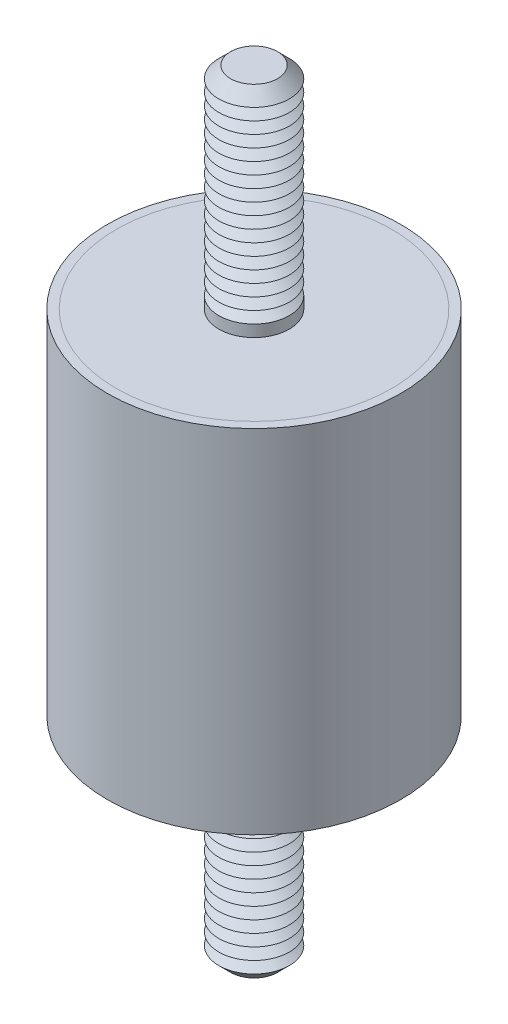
ISO-10303-21;
HEADER;
FILE_DESCRIPTION(('STEP AP214'),'2;1');
FILE_NAME('part.step','',(''),(''),'','','');
FILE_SCHEMA(('AUTOMOTIVE_DESIGN { 1 0 10303 214 1 1 1 1 }'));
ENDSEC;
DATA;
#1=APPLICATION_CONTEXT('core data for automotive mechanical design processes');
#2=APPLICATION_PROTOCOL_DEFINITION('international standard','automotive_design',2000,#1);
#3=PRODUCT_CONTEXT('',#1,'mechanical');
#4=PRODUCT('Part','Part','',(#3));
#5=PRODUCT_RELATED_PRODUCT_CATEGORY('part','',(#4));
#6=PRODUCT_DEFINITION_FORMATION('','',#4);
#7=PRODUCT_DEFINITION_CONTEXT('part definition',#1,'design');
#8=PRODUCT_DEFINITION('design','',#6,#7);
#9=PRODUCT_DEFINITION_SHAPE('','',#8);
#10=(LENGTH_UNIT() NAMED_UNIT(*) SI_UNIT(.MILLI.,.METRE.));
#11=(NAMED_UNIT(*) PLANE_ANGLE_UNIT() SI_UNIT($,.RADIAN.));
#12=(NAMED_UNIT(*) SI_UNIT($,.STERADIAN.) SOLID_ANGLE_UNIT());
#13=UNCERTAINTY_MEASURE_WITH_UNIT(LENGTH_MEASURE(1.E-05),#10,'distance_accuracy_value','');
#14=(GEOMETRIC_REPRESENTATION_CONTEXT(3) GLOBAL_UNCERTAINTY_ASSIGNED_CONTEXT((#13)) GLOBAL_UNIT_ASSIGNED_CONTEXT((#10,
#11,#12)) REPRESENTATION_CONTEXT('',''));
#15=CARTESIAN_POINT('',(0.,0.,0.));
#16=DIRECTION('',(0.,0.,1.));
#17=DIRECTION('',(1.,0.,0.));
#18=AXIS2_PLACEMENT_3D('',#15,#16,#17);
#19=CARTESIAN_POINT('',(0.,-33.,0.));
#20=DIRECTION('',(0.,1.,0.));
#21=DIRECTION('',(0.,0.,1.));
#22=AXIS2_PLACEMENT_3D('',#19,#20,#21);
#23=CYLINDRICAL_SURFACE('',#22,3.);
#24=CARTESIAN_POINT('',(0.,-15.,0.));
#25=DIRECTION('',(0.,-1.,0.));
#26=DIRECTION('',(0.,0.,-1.));
#27=AXIS2_PLACEMENT_3D('',#24,#25,#26);
#28=CIRCLE('',#27,3.);
#29=CARTESIAN_POINT('',(0.,-15.,-3.));
#30=VERTEX_POINT('',#29);
#31=EDGE_CURVE('P0_E21',#30,#30,#28,.T.);
#32=ORIENTED_EDGE('',*,*,#31,.T.);
#33=EDGE_LOOP('',(#32));
#34=FACE_BOUND('',#33,.T.);
#35=CARTESIAN_POINT('',(0.,-16.,0.));
#36=DIRECTION('',(0.,1.,0.));
#37=DIRECTION('',(0.,0.,1.));
#38=AXIS2_PLACEMENT_3D('',#35,#36,#37);
#39=CIRCLE('',#38,3.);
#40=CARTESIAN_POINT('',(0.,-16.,3.));
#41=VERTEX_POINT('',#40);
#42=EDGE_CURVE('P0_E33',#41,#41,#39,.T.);
#43=ORIENTED_EDGE('',*,*,#42,.T.);
#44=EDGE_LOOP('',(#43));
#45=FACE_BOUND('',#44,.T.);
#46=ADVANCED_FACE('P0_F14',(#34,#45),#23,.T.);
#47=CARTESIAN_POINT('',(0.,-15.,0.));
#48=DIRECTION('',(0.,1.,0.));
#49=DIRECTION('',(0.,0.,1.));
#50=AXIS2_PLACEMENT_3D('',#47,#48,#49);
#51=CYLINDRICAL_SURFACE('',#50,11.75);
#52=CARTESIAN_POINT('',(0.,-15.,0.));
#53=DIRECTION('',(0.,1.,0.));
#54=DIRECTION('',(0.,0.,1.));
#55=AXIS2_PLACEMENT_3D('',#52,#53,#54);
#56=CIRCLE('',#55,11.75);
#57=CARTESIAN_POINT('',(0.,-15.,11.75));
#58=VERTEX_POINT('',#57);
#59=EDGE_CURVE('P0_E25',#58,#58,#56,.T.);
#60=ORIENTED_EDGE('',*,*,#59,.T.);
#61=EDGE_LOOP('',(#60));
#62=FACE_BOUND('',#61,.T.);
#63=CARTESIAN_POINT('',(0.,-13.5,0.));
#64=DIRECTION('',(0.,1.,0.));
#65=DIRECTION('',(0.,0.,1.));
#66=AXIS2_PLACEMENT_3D('',#63,#64,#65);
#67=CIRCLE('',#66,11.75);
#68=CARTESIAN_POINT('',(0.,-13.5,11.75));
#69=VERTEX_POINT('',#68);
#70=EDGE_CURVE('P0_E30',#69,#69,#67,.T.);
#71=ORIENTED_EDGE('',*,*,#70,.F.);
#72=EDGE_LOOP('',(#71));
#73=FACE_BOUND('',#72,.T.);
#74=ADVANCED_FACE('P0_F157',(#62,#73),#51,.T.);
#75=CARTESIAN_POINT('',(0.,-15.,0.));
#76=DIRECTION('',(0.,1.,0.));
#77=DIRECTION('',(0.,0.,1.));
#78=AXIS2_PLACEMENT_3D('',#75,#76,#77);
#79=PLANE('',#78);
#80=ORIENTED_EDGE('',*,*,#31,.F.);
#81=EDGE_LOOP('',(#80));
#82=FACE_BOUND('',#81,.T.);
#83=ORIENTED_EDGE('',*,*,#59,.F.);
#84=EDGE_LOOP('',(#83));
#85=FACE_BOUND('',#84,.T.);
#86=ADVANCED_FACE('P0_F162',(#82,#85),#79,.F.);
#87=CARTESIAN_POINT('',(0.,-13.5,0.));
#88=DIRECTION('',(0.,1.,0.));
#89=DIRECTION('',(0.,0.,1.));
#90=AXIS2_PLACEMENT_3D('',#87,#88,#89);
#91=PLANE('',#90);
#92=ORIENTED_EDGE('',*,*,#70,.T.);
#93=EDGE_LOOP('',(#92));
#94=FACE_BOUND('',#93,.T.);
#95=ADVANCED_FACE('P0_F168',(#94),#91,.T.);
#96=CARTESIAN_POINT('',(0.,-16.,0.));
#97=DIRECTION('',(0.,1.,0.));
#98=DIRECTION('',(0.,0.,1.));
#99=AXIS2_PLACEMENT_3D('',#96,#97,#98);
#100=CONICAL_SURFACE('',#99,3.,1.0471975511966);
#101=CARTESIAN_POINT('',(0.,-16.5,0.));
#102=DIRECTION('',(0.,1.,0.));
#103=DIRECTION('',(0.,0.,1.));
#104=AXIS2_PLACEMENT_3D('',#101,#102,#103);
#105=CIRCLE('',#104,2.13397459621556);
#106=CARTESIAN_POINT('',(0.,-16.5,2.13397459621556));
#107=VERTEX_POINT('',#106);
#108=EDGE_CURVE('P0_E39',#107,#107,#105,.T.);
#109=ORIENTED_EDGE('',*,*,#108,.T.);
#110=EDGE_LOOP('',(#109));
#111=FACE_BOUND('',#110,.T.);
#112=ORIENTED_EDGE('',*,*,#42,.F.);
#113=EDGE_LOOP('',(#112));
#114=FACE_BOUND('',#113,.T.);
#115=ADVANCED_FACE('P0_F171',(#111,#114),#100,.T.);
#116=CARTESIAN_POINT('',(0.,-16.5,0.));
#117=DIRECTION('',(0.,-1.,0.));
#118=DIRECTION('',(0.,0.,-1.));
#119=AXIS2_PLACEMENT_3D('',#116,#117,#118);
#120=CONICAL_SURFACE('',#119,2.13397459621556,1.0471975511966);
#121=CARTESIAN_POINT('',(0.,-17.,0.));
#122=DIRECTION('',(0.,1.,0.));
#123=DIRECTION('',(0.,0.,1.));
#124=AXIS2_PLACEMENT_3D('',#121,#122,#123);
#125=CIRCLE('',#124,3.);
#126=CARTESIAN_POINT('',(0.,-17.,3.));
#127=VERTEX_POINT('',#126);
#128=EDGE_CURVE('P0_E43',#127,#127,#125,.T.);
#129=ORIENTED_EDGE('',*,*,#128,.T.);
#130=EDGE_LOOP('',(#129));
#131=FACE_BOUND('',#130,.T.);
#132=ORIENTED_EDGE('',*,*,#108,.F.);
#133=EDGE_LOOP('',(#132));
#134=FACE_BOUND('',#133,.T.);
#135=ADVANCED_FACE('P0_F175',(#131,#134),#120,.T.);
#136=CARTESIAN_POINT('',(0.,-17.,0.));
#137=DIRECTION('',(0.,1.,0.));
#138=DIRECTION('',(0.,0.,1.));
#139=AXIS2_PLACEMENT_3D('',#136,#137,#138);
#140=CONICAL_SURFACE('',#139,3.,1.0471975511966);
#141=CARTESIAN_POINT('',(0.,-17.5,0.));
#142=DIRECTION('',(0.,1.,0.));
#143=DIRECTION('',(0.,0.,1.));
#144=AXIS2_PLACEMENT_3D('',#141,#142,#143);
#145=CIRCLE('',#144,2.13397459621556);
#146=CARTESIAN_POINT('',(0.,-17.5,2.13397459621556));
#147=VERTEX_POINT('',#146);
#148=EDGE_CURVE('P0_E47',#147,#147,#145,.T.);
#149=ORIENTED_EDGE('',*,*,#148,.T.);
#150=EDGE_LOOP('',(#149));
#151=FACE_BOUND('',#150,.T.);
#152=ORIENTED_EDGE('',*,*,#128,.F.);
#153=EDGE_LOOP('',(#152));
#154=FACE_BOUND('',#153,.T.);
#155=ADVANCED_FACE('P0_F179',(#151,#154),#140,.T.);
#156=CARTESIAN_POINT('',(0.,-17.5,0.));
#157=DIRECTION('',(0.,-1.,0.));
#158=DIRECTION('',(0.,0.,-1.));
#159=AXIS2_PLACEMENT_3D('',#156,#157,#158);
#160=CONICAL_SURFACE('',#159,2.13397459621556,1.0471975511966);
#161=CARTESIAN_POINT('',(0.,-18.,0.));
#162=DIRECTION('',(0.,1.,0.));
#163=DIRECTION('',(0.,0.,1.));
#164=AXIS2_PLACEMENT_3D('',#161,#162,#163);
#165=CIRCLE('',#164,3.);
#166=CARTESIAN_POINT('',(0.,-18.,3.));
#167=VERTEX_POINT('',#166);
#168=EDGE_CURVE('P0_E52',#167,#167,#165,.T.);
#169=ORIENTED_EDGE('',*,*,#168,.T.);
#170=EDGE_LOOP('',(#169));
#171=FACE_BOUND('',#170,.T.);
#172=ORIENTED_EDGE('',*,*,#148,.F.);
#173=EDGE_LOOP('',(#172));
#174=FACE_BOUND('',#173,.T.);
#175=ADVANCED_FACE('P0_F186',(#171,#174),#160,.T.);
#176=CARTESIAN_POINT('',(0.,-18.,0.));
#177=DIRECTION('',(0.,1.,0.));
#178=DIRECTION('',(0.,0.,1.));
#179=AXIS2_PLACEMENT_3D('',#176,#177,#178);
#180=CONICAL_SURFACE('',#179,3.,1.0471975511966);
#181=CARTESIAN_POINT('',(0.,-18.5,0.));
#182=DIRECTION('',(0.,1.,0.));
#183=DIRECTION('',(0.,0.,1.));
#184=AXIS2_PLACEMENT_3D('',#181,#182,#183);
#185=CIRCLE('',#184,2.13397459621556);
#186=CARTESIAN_POINT('',(0.,-18.5,2.13397459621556));
#187=VERTEX_POINT('',#186);
#188=EDGE_CURVE('P0_E55',#187,#187,#185,.T.);
#189=ORIENTED_EDGE('',*,*,#188,.T.);
#190=EDGE_LOOP('',(#189));
#191=FACE_BOUND('',#190,.T.);
#192=ORIENTED_EDGE('',*,*,#168,.F.);
#193=EDGE_LOOP('',(#192));
#194=FACE_BOUND('',#193,.T.);
#195=ADVANCED_FACE('P0_F190',(#191,#194),#180,.T.);
#196=CARTESIAN_POINT('',(0.,-18.5,0.));
#197=DIRECTION('',(0.,-1.,0.));
#198=DIRECTION('',(0.,0.,-1.));
#199=AXIS2_PLACEMENT_3D('',#196,#197,#198);
#200=CONICAL_SURFACE('',#199,2.13397459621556,1.0471975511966);
#201=CARTESIAN_POINT('',(0.,-19.,0.));
#202=DIRECTION('',(0.,1.,0.));
#203=DIRECTION('',(0.,0.,1.));
#204=AXIS2_PLACEMENT_3D('',#201,#202,#203);
#205=CIRCLE('',#204,3.);
#206=CARTESIAN_POINT('',(0.,-19.,3.));
#207=VERTEX_POINT('',#206);
#208=EDGE_CURVE('P0_E58',#207,#207,#205,.T.);
#209=ORIENTED_EDGE('',*,*,#208,.T.);
#210=EDGE_LOOP('',(#209));
#211=FACE_BOUND('',#210,.T.);
#212=ORIENTED_EDGE('',*,*,#188,.F.);
#213=EDGE_LOOP('',(#212));
#214=FACE_BOUND('',#213,.T.);
#215=ADVANCED_FACE('P0_F194',(#211,#214),#200,.T.);
#216=CARTESIAN_POINT('',(0.,-19.,0.));
#217=DIRECTION('',(0.,1.,0.));
#218=DIRECTION('',(0.,0.,1.));
#219=AXIS2_PLACEMENT_3D('',#216,#217,#218);
#220=CONICAL_SURFACE('',#219,3.,1.0471975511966);
#221=CARTESIAN_POINT('',(0.,-19.5,0.));
#222=DIRECTION('',(0.,1.,0.));
#223=DIRECTION('',(0.,0.,1.));
#224=AXIS2_PLACEMENT_3D('',#221,#222,#223);
#225=CIRCLE('',#224,2.13397459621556);
#226=CARTESIAN_POINT('',(0.,-19.5,2.13397459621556));
#227=VERTEX_POINT('',#226);
#228=EDGE_CURVE('P0_E61',#227,#227,#225,.T.);
#229=ORIENTED_EDGE('',*,*,#228,.T.);
#230=EDGE_LOOP('',(#229));
#231=FACE_BOUND('',#230,.T.);
#232=ORIENTED_EDGE('',*,*,#208,.F.);
#233=EDGE_LOOP('',(#232));
#234=FACE_BOUND('',#233,.T.);
#235=ADVANCED_FACE('P0_F198',(#231,#234),#220,.T.);
#236=CARTESIAN_POINT('',(0.,-19.5,0.));
#237=DIRECTION('',(0.,-1.,0.));
#238=DIRECTION('',(0.,0.,-1.));
#239=AXIS2_PLACEMENT_3D('',#236,#237,#238);
#240=CONICAL_SURFACE('',#239,2.13397459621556,1.0471975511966);
#241=CARTESIAN_POINT('',(0.,-20.,0.));
#242=DIRECTION('',(0.,1.,0.));
#243=DIRECTION('',(0.,0.,1.));
#244=AXIS2_PLACEMENT_3D('',#241,#242,#243);
#245=CIRCLE('',#244,3.);
#246=CARTESIAN_POINT('',(0.,-20.,3.));
#247=VERTEX_POINT('',#246);
#248=EDGE_CURVE('P0_E64',#247,#247,#245,.T.);
#249=ORIENTED_EDGE('',*,*,#248,.T.);
#250=EDGE_LOOP('',(#249));
#251=FACE_BOUND('',#250,.T.);
#252=ORIENTED_EDGE('',*,*,#228,.F.);
#253=EDGE_LOOP('',(#252));
#254=FACE_BOUND('',#253,.T.);
#255=ADVANCED_FACE('P0_F202',(#251,#254),#240,.T.);
#256=CARTESIAN_POINT('',(0.,-20.,0.));
#257=DIRECTION('',(0.,1.,0.));
#258=DIRECTION('',(0.,0.,1.));
#259=AXIS2_PLACEMENT_3D('',#256,#257,#258);
#260=CONICAL_SURFACE('',#259,3.,1.0471975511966);
#261=CARTESIAN_POINT('',(0.,-20.5,0.));
#262=DIRECTION('',(0.,1.,0.));
#263=DIRECTION('',(0.,0.,1.));
#264=AXIS2_PLACEMENT_3D('',#261,#262,#263);
#265=CIRCLE('',#264,2.13397459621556);
#266=CARTESIAN_POINT('',(0.,-20.5,2.13397459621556));
#267=VERTEX_POINT('',#266);
#268=EDGE_CURVE('P0_E67',#267,#267,#265,.T.);
#269=ORIENTED_EDGE('',*,*,#268,.T.);
#270=EDGE_LOOP('',(#269));
#271=FACE_BOUND('',#270,.T.);
#272=ORIENTED_EDGE('',*,*,#248,.F.);
#273=EDGE_LOOP('',(#272));
#274=FACE_BOUND('',#273,.T.);
#275=ADVANCED_FACE('P0_F206',(#271,#274),#260,.T.);
#276=CARTESIAN_POINT('',(0.,-20.5,0.));
#277=DIRECTION('',(0.,-1.,0.));
#278=DIRECTION('',(0.,0.,-1.));
#279=AXIS2_PLACEMENT_3D('',#276,#277,#278);
#280=CONICAL_SURFACE('',#279,2.13397459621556,1.0471975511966);
#281=CARTESIAN_POINT('',(0.,-21.,0.));
#282=DIRECTION('',(0.,1.,0.));
#283=DIRECTION('',(0.,0.,1.));
#284=AXIS2_PLACEMENT_3D('',#281,#282,#283);
#285=CIRCLE('',#284,3.);
#286=CARTESIAN_POINT('',(0.,-21.,3.));
#287=VERTEX_POINT('',#286);
#288=EDGE_CURVE('P0_E70',#287,#287,#285,.T.);
#289=ORIENTED_EDGE('',*,*,#288,.T.);
#290=EDGE_LOOP('',(#289));
#291=FACE_BOUND('',#290,.T.);
#292=ORIENTED_EDGE('',*,*,#268,.F.);
#293=EDGE_LOOP('',(#292));
#294=FACE_BOUND('',#293,.T.);
#295=ADVANCED_FACE('P0_F210',(#291,#294),#280,.T.);
#296=CARTESIAN_POINT('',(0.,-21.,0.));
#297=DIRECTION('',(0.,1.,0.));
#298=DIRECTION('',(0.,0.,1.));
#299=AXIS2_PLACEMENT_3D('',#296,#297,#298);
#300=CONICAL_SURFACE('',#299,3.,1.0471975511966);
#301=CARTESIAN_POINT('',(0.,-21.5,0.));
#302=DIRECTION('',(0.,1.,0.));
#303=DIRECTION('',(0.,0.,1.));
#304=AXIS2_PLACEMENT_3D('',#301,#302,#303);
#305=CIRCLE('',#304,2.13397459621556);
#306=CARTESIAN_POINT('',(0.,-21.5,2.13397459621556));
#307=VERTEX_POINT('',#306);
#308=EDGE_CURVE('P0_E73',#307,#307,#305,.T.);
#309=ORIENTED_EDGE('',*,*,#308,.T.);
#310=EDGE_LOOP('',(#309));
#311=FACE_BOUND('',#310,.T.);
#312=ORIENTED_EDGE('',*,*,#288,.F.);
#313=EDGE_LOOP('',(#312));
#314=FACE_BOUND('',#313,.T.);
#315=ADVANCED_FACE('P0_F214',(#311,#314),#300,.T.);
#316=CARTESIAN_POINT('',(0.,-21.5,0.));
#317=DIRECTION('',(0.,-1.,0.));
#318=DIRECTION('',(0.,0.,-1.));
#319=AXIS2_PLACEMENT_3D('',#316,#317,#318);
#320=CONICAL_SURFACE('',#319,2.13397459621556,1.0471975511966);
#321=CARTESIAN_POINT('',(0.,-22.,0.));
#322=DIRECTION('',(0.,1.,0.));
#323=DIRECTION('',(0.,0.,1.));
#324=AXIS2_PLACEMENT_3D('',#321,#322,#323);
#325=CIRCLE('',#324,3.);
#326=CARTESIAN_POINT('',(0.,-22.,3.));
#327=VERTEX_POINT('',#326);
#328=EDGE_CURVE('P0_E76',#327,#327,#325,.T.);
#329=ORIENTED_EDGE('',*,*,#328,.T.);
#330=EDGE_LOOP('',(#329));
#331=FACE_BOUND('',#330,.T.);
#332=ORIENTED_EDGE('',*,*,#308,.F.);
#333=EDGE_LOOP('',(#332));
#334=FACE_BOUND('',#333,.T.);
#335=ADVANCED_FACE('P0_F218',(#331,#334),#320,.T.);
#336=CARTESIAN_POINT('',(0.,-22.,0.));
#337=DIRECTION('',(0.,1.,0.));
#338=DIRECTION('',(0.,0.,1.));
#339=AXIS2_PLACEMENT_3D('',#336,#337,#338);
#340=CONICAL_SURFACE('',#339,3.,1.0471975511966);
#341=CARTESIAN_POINT('',(0.,-22.5,0.));
#342=DIRECTION('',(0.,1.,0.));
#343=DIRECTION('',(0.,0.,1.));
#344=AXIS2_PLACEMENT_3D('',#341,#342,#343);
#345=CIRCLE('',#344,2.13397459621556);
#346=CARTESIAN_POINT('',(0.,-22.5,2.13397459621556));
#347=VERTEX_POINT('',#346);
#348=EDGE_CURVE('P0_E79',#347,#347,#345,.T.);
#349=ORIENTED_EDGE('',*,*,#348,.T.);
#350=EDGE_LOOP('',(#349));
#351=FACE_BOUND('',#350,.T.);
#352=ORIENTED_EDGE('',*,*,#328,.F.);
#353=EDGE_LOOP('',(#352));
#354=FACE_BOUND('',#353,.T.);
#355=ADVANCED_FACE('P0_F222',(#351,#354),#340,.T.);
#356=CARTESIAN_POINT('',(0.,-22.5,0.));
#357=DIRECTION('',(0.,-1.,0.));
#358=DIRECTION('',(0.,0.,-1.));
#359=AXIS2_PLACEMENT_3D('',#356,#357,#358);
#360=CONICAL_SURFACE('',#359,2.13397459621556,1.0471975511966);
#361=CARTESIAN_POINT('',(0.,-23.,0.));
#362=DIRECTION('',(0.,1.,0.));
#363=DIRECTION('',(0.,0.,1.));
#364=AXIS2_PLACEMENT_3D('',#361,#362,#363);
#365=CIRCLE('',#364,3.);
#366=CARTESIAN_POINT('',(0.,-23.,3.));
#367=VERTEX_POINT('',#366);
#368=EDGE_CURVE('P0_E82',#367,#367,#365,.T.);
#369=ORIENTED_EDGE('',*,*,#368,.T.);
#370=EDGE_LOOP('',(#369));
#371=FACE_BOUND('',#370,.T.);
#372=ORIENTED_EDGE('',*,*,#348,.F.);
#373=EDGE_LOOP('',(#372));
#374=FACE_BOUND('',#373,.T.);
#375=ADVANCED_FACE('P0_F226',(#371,#374),#360,.T.);
#376=CARTESIAN_POINT('',(0.,-23.,0.));
#377=DIRECTION('',(0.,1.,0.));
#378=DIRECTION('',(0.,0.,1.));
#379=AXIS2_PLACEMENT_3D('',#376,#377,#378);
#380=CONICAL_SURFACE('',#379,3.,1.0471975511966);
#381=CARTESIAN_POINT('',(0.,-23.5,0.));
#382=DIRECTION('',(0.,1.,0.));
#383=DIRECTION('',(0.,0.,1.));
#384=AXIS2_PLACEMENT_3D('',#381,#382,#383);
#385=CIRCLE('',#384,2.13397459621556);
#386=CARTESIAN_POINT('',(0.,-23.5,2.13397459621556));
#387=VERTEX_POINT('',#386);
#388=EDGE_CURVE('P0_E85',#387,#387,#385,.T.);
#389=ORIENTED_EDGE('',*,*,#388,.T.);
#390=EDGE_LOOP('',(#389));
#391=FACE_BOUND('',#390,.T.);
#392=ORIENTED_EDGE('',*,*,#368,.F.);
#393=EDGE_LOOP('',(#392));
#394=FACE_BOUND('',#393,.T.);
#395=ADVANCED_FACE('P0_F230',(#391,#394),#380,.T.);
#396=CARTESIAN_POINT('',(0.,-23.5,0.));
#397=DIRECTION('',(0.,-1.,0.));
#398=DIRECTION('',(0.,0.,-1.));
#399=AXIS2_PLACEMENT_3D('',#396,#397,#398);
#400=CONICAL_SURFACE('',#399,2.13397459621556,1.0471975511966);
#401=CARTESIAN_POINT('',(0.,-24.,0.));
#402=DIRECTION('',(0.,1.,0.));
#403=DIRECTION('',(0.,0.,1.));
#404=AXIS2_PLACEMENT_3D('',#401,#402,#403);
#405=CIRCLE('',#404,3.);
#406=CARTESIAN_POINT('',(0.,-24.,3.));
#407=VERTEX_POINT('',#406);
#408=EDGE_CURVE('P0_E88',#407,#407,#405,.T.);
#409=ORIENTED_EDGE('',*,*,#408,.T.);
#410=EDGE_LOOP('',(#409));
#411=FACE_BOUND('',#410,.T.);
#412=ORIENTED_EDGE('',*,*,#388,.F.);
#413=EDGE_LOOP('',(#412));
#414=FACE_BOUND('',#413,.T.);
#415=ADVANCED_FACE('P0_F234',(#411,#414),#400,.T.);
#416=CARTESIAN_POINT('',(0.,-24.,0.));
#417=DIRECTION('',(0.,1.,0.));
#418=DIRECTION('',(0.,0.,1.));
#419=AXIS2_PLACEMENT_3D('',#416,#417,#418);
#420=CONICAL_SURFACE('',#419,3.,1.0471975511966);
#421=CARTESIAN_POINT('',(0.,-24.5,0.));
#422=DIRECTION('',(0.,1.,0.));
#423=DIRECTION('',(0.,0.,1.));
#424=AXIS2_PLACEMENT_3D('',#421,#422,#423);
#425=CIRCLE('',#424,2.13397459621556);
#426=CARTESIAN_POINT('',(0.,-24.5,2.13397459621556));
#427=VERTEX_POINT('',#426);
#428=EDGE_CURVE('P0_E91',#427,#427,#425,.T.);
#429=ORIENTED_EDGE('',*,*,#428,.T.);
#430=EDGE_LOOP('',(#429));
#431=FACE_BOUND('',#430,.T.);
#432=ORIENTED_EDGE('',*,*,#408,.F.);
#433=EDGE_LOOP('',(#432));
#434=FACE_BOUND('',#433,.T.);
#435=ADVANCED_FACE('P0_F238',(#431,#434),#420,.T.);
#436=CARTESIAN_POINT('',(0.,-24.5,0.));
#437=DIRECTION('',(0.,-1.,0.));
#438=DIRECTION('',(0.,0.,-1.));
#439=AXIS2_PLACEMENT_3D('',#436,#437,#438);
#440=CONICAL_SURFACE('',#439,2.13397459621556,1.0471975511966);
#441=CARTESIAN_POINT('',(0.,-25.,0.));
#442=DIRECTION('',(0.,1.,0.));
#443=DIRECTION('',(0.,0.,1.));
#444=AXIS2_PLACEMENT_3D('',#441,#442,#443);
#445=CIRCLE('',#444,3.);
#446=CARTESIAN_POINT('',(0.,-25.,3.));
#447=VERTEX_POINT('',#446);
#448=EDGE_CURVE('P0_E94',#447,#447,#445,.T.);
#449=ORIENTED_EDGE('',*,*,#448,.T.);
#450=EDGE_LOOP('',(#449));
#451=FACE_BOUND('',#450,.T.);
#452=ORIENTED_EDGE('',*,*,#428,.F.);
#453=EDGE_LOOP('',(#452));
#454=FACE_BOUND('',#453,.T.);
#455=ADVANCED_FACE('P0_F242',(#451,#454),#440,.T.);
#456=CARTESIAN_POINT('',(0.,-25.,0.));
#457=DIRECTION('',(0.,1.,0.));
#458=DIRECTION('',(0.,0.,1.));
#459=AXIS2_PLACEMENT_3D('',#456,#457,#458);
#460=CONICAL_SURFACE('',#459,3.,1.0471975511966);
#461=CARTESIAN_POINT('',(0.,-25.5,0.));
#462=DIRECTION('',(0.,1.,0.));
#463=DIRECTION('',(0.,0.,1.));
#464=AXIS2_PLACEMENT_3D('',#461,#462,#463);
#465=CIRCLE('',#464,2.13397459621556);
#466=CARTESIAN_POINT('',(0.,-25.5,2.13397459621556));
#467=VERTEX_POINT('',#466);
#468=EDGE_CURVE('P0_E97',#467,#467,#465,.T.);
#469=ORIENTED_EDGE('',*,*,#468,.T.);
#470=EDGE_LOOP('',(#469));
#471=FACE_BOUND('',#470,.T.);
#472=ORIENTED_EDGE('',*,*,#448,.F.);
#473=EDGE_LOOP('',(#472));
#474=FACE_BOUND('',#473,.T.);
#475=ADVANCED_FACE('P0_F246',(#471,#474),#460,.T.);
#476=CARTESIAN_POINT('',(0.,-25.5,0.));
#477=DIRECTION('',(0.,-1.,0.));
#478=DIRECTION('',(0.,0.,-1.));
#479=AXIS2_PLACEMENT_3D('',#476,#477,#478);
#480=CONICAL_SURFACE('',#479,2.13397459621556,1.0471975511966);
#481=CARTESIAN_POINT('',(0.,-26.,0.));
#482=DIRECTION('',(0.,1.,0.));
#483=DIRECTION('',(0.,0.,1.));
#484=AXIS2_PLACEMENT_3D('',#481,#482,#483);
#485=CIRCLE('',#484,3.);
#486=CARTESIAN_POINT('',(0.,-26.,3.));
#487=VERTEX_POINT('',#486);
#488=EDGE_CURVE('P0_E100',#487,#487,#485,.T.);
#489=ORIENTED_EDGE('',*,*,#488,.T.);
#490=EDGE_LOOP('',(#489));
#491=FACE_BOUND('',#490,.T.);
#492=ORIENTED_EDGE('',*,*,#468,.F.);
#493=EDGE_LOOP('',(#492));
#494=FACE_BOUND('',#493,.T.);
#495=ADVANCED_FACE('P0_F250',(#491,#494),#480,.T.);
#496=CARTESIAN_POINT('',(0.,-26.,0.));
#497=DIRECTION('',(0.,1.,0.));
#498=DIRECTION('',(0.,0.,1.));
#499=AXIS2_PLACEMENT_3D('',#496,#497,#498);
#500=CONICAL_SURFACE('',#499,3.,1.0471975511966);
#501=CARTESIAN_POINT('',(0.,-26.5,0.));
#502=DIRECTION('',(0.,1.,0.));
#503=DIRECTION('',(0.,0.,1.));
#504=AXIS2_PLACEMENT_3D('',#501,#502,#503);
#505=CIRCLE('',#504,2.13397459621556);
#506=CARTESIAN_POINT('',(0.,-26.5,2.13397459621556));
#507=VERTEX_POINT('',#506);
#508=EDGE_CURVE('P0_E103',#507,#507,#505,.T.);
#509=ORIENTED_EDGE('',*,*,#508,.T.);
#510=EDGE_LOOP('',(#509));
#511=FACE_BOUND('',#510,.T.);
#512=ORIENTED_EDGE('',*,*,#488,.F.);
#513=EDGE_LOOP('',(#512));
#514=FACE_BOUND('',#513,.T.);
#515=ADVANCED_FACE('P0_F254',(#511,#514),#500,.T.);
#516=CARTESIAN_POINT('',(0.,-26.5,0.));
#517=DIRECTION('',(0.,-1.,0.));
#518=DIRECTION('',(0.,0.,-1.));
#519=AXIS2_PLACEMENT_3D('',#516,#517,#518);
#520=CONICAL_SURFACE('',#519,2.13397459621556,1.0471975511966);
#521=CARTESIAN_POINT('',(0.,-27.,0.));
#522=DIRECTION('',(0.,1.,0.));
#523=DIRECTION('',(0.,0.,1.));
#524=AXIS2_PLACEMENT_3D('',#521,#522,#523);
#525=CIRCLE('',#524,3.);
#526=CARTESIAN_POINT('',(0.,-27.,3.));
#527=VERTEX_POINT('',#526);
#528=EDGE_CURVE('P0_E106',#527,#527,#525,.T.);
#529=ORIENTED_EDGE('',*,*,#528,.T.);
#530=EDGE_LOOP('',(#529));
#531=FACE_BOUND('',#530,.T.);
#532=ORIENTED_EDGE('',*,*,#508,.F.);
#533=EDGE_LOOP('',(#532));
#534=FACE_BOUND('',#533,.T.);
#535=ADVANCED_FACE('P0_F258',(#531,#534),#520,.T.);
#536=CARTESIAN_POINT('',(0.,-27.,0.));
#537=DIRECTION('',(0.,1.,0.));
#538=DIRECTION('',(0.,0.,1.));
#539=AXIS2_PLACEMENT_3D('',#536,#537,#538);
#540=CONICAL_SURFACE('',#539,3.,1.0471975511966);
#541=CARTESIAN_POINT('',(0.,-27.5,0.));
#542=DIRECTION('',(0.,1.,0.));
#543=DIRECTION('',(0.,0.,1.));
#544=AXIS2_PLACEMENT_3D('',#541,#542,#543);
#545=CIRCLE('',#544,2.13397459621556);
#546=CARTESIAN_POINT('',(0.,-27.5,2.13397459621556));
#547=VERTEX_POINT('',#546);
#548=EDGE_CURVE('P0_E109',#547,#547,#545,.T.);
#549=ORIENTED_EDGE('',*,*,#548,.T.);
#550=EDGE_LOOP('',(#549));
#551=FACE_BOUND('',#550,.T.);
#552=ORIENTED_EDGE('',*,*,#528,.F.);
#553=EDGE_LOOP('',(#552));
#554=FACE_BOUND('',#553,.T.);
#555=ADVANCED_FACE('P0_F262',(#551,#554),#540,.T.);
#556=CARTESIAN_POINT('',(0.,-27.5,0.));
#557=DIRECTION('',(0.,-1.,0.));
#558=DIRECTION('',(0.,0.,-1.));
#559=AXIS2_PLACEMENT_3D('',#556,#557,#558);
#560=CONICAL_SURFACE('',#559,2.13397459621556,1.0471975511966);
#561=CARTESIAN_POINT('',(0.,-28.,0.));
#562=DIRECTION('',(0.,1.,0.));
#563=DIRECTION('',(0.,0.,1.));
#564=AXIS2_PLACEMENT_3D('',#561,#562,#563);
#565=CIRCLE('',#564,3.);
#566=CARTESIAN_POINT('',(0.,-28.,3.));
#567=VERTEX_POINT('',#566);
#568=EDGE_CURVE('P0_E112',#567,#567,#565,.T.);
#569=ORIENTED_EDGE('',*,*,#568,.T.);
#570=EDGE_LOOP('',(#569));
#571=FACE_BOUND('',#570,.T.);
#572=ORIENTED_EDGE('',*,*,#548,.F.);
#573=EDGE_LOOP('',(#572));
#574=FACE_BOUND('',#573,.T.);
#575=ADVANCED_FACE('P0_F266',(#571,#574),#560,.T.);
#576=CARTESIAN_POINT('',(0.,-28.,0.));
#577=DIRECTION('',(0.,1.,0.));
#578=DIRECTION('',(0.,0.,1.));
#579=AXIS2_PLACEMENT_3D('',#576,#577,#578);
#580=CONICAL_SURFACE('',#579,3.,1.0471975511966);
#581=CARTESIAN_POINT('',(0.,-28.5,0.));
#582=DIRECTION('',(0.,1.,0.));
#583=DIRECTION('',(0.,0.,1.));
#584=AXIS2_PLACEMENT_3D('',#581,#582,#583);
#585=CIRCLE('',#584,2.13397459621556);
#586=CARTESIAN_POINT('',(0.,-28.5,2.13397459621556));
#587=VERTEX_POINT('',#586);
#588=EDGE_CURVE('P0_E115',#587,#587,#585,.T.);
#589=ORIENTED_EDGE('',*,*,#588,.T.);
#590=EDGE_LOOP('',(#589));
#591=FACE_BOUND('',#590,.T.);
#592=ORIENTED_EDGE('',*,*,#568,.F.);
#593=EDGE_LOOP('',(#592));
#594=FACE_BOUND('',#593,.T.);
#595=ADVANCED_FACE('P0_F270',(#591,#594),#580,.T.);
#596=CARTESIAN_POINT('',(0.,-28.5,0.));
#597=DIRECTION('',(0.,-1.,0.));
#598=DIRECTION('',(0.,0.,-1.));
#599=AXIS2_PLACEMENT_3D('',#596,#597,#598);
#600=CONICAL_SURFACE('',#599,2.13397459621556,1.0471975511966);
#601=CARTESIAN_POINT('',(0.,-29.,0.));
#602=DIRECTION('',(0.,1.,0.));
#603=DIRECTION('',(0.,0.,1.));
#604=AXIS2_PLACEMENT_3D('',#601,#602,#603);
#605=CIRCLE('',#604,3.);
#606=CARTESIAN_POINT('',(0.,-29.,3.));
#607=VERTEX_POINT('',#606);
#608=EDGE_CURVE('P0_E118',#607,#607,#605,.T.);
#609=ORIENTED_EDGE('',*,*,#608,.T.);
#610=EDGE_LOOP('',(#609));
#611=FACE_BOUND('',#610,.T.);
#612=ORIENTED_EDGE('',*,*,#588,.F.);
#613=EDGE_LOOP('',(#612));
#614=FACE_BOUND('',#613,.T.);
#615=ADVANCED_FACE('P0_F274',(#611,#614),#600,.T.);
#616=CARTESIAN_POINT('',(0.,-29.,0.));
#617=DIRECTION('',(0.,1.,0.));
#618=DIRECTION('',(0.,0.,1.));
#619=AXIS2_PLACEMENT_3D('',#616,#617,#618);
#620=CONICAL_SURFACE('',#619,3.,1.0471975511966);
#621=CARTESIAN_POINT('',(0.,-29.5,0.));
#622=DIRECTION('',(0.,1.,0.));
#623=DIRECTION('',(0.,0.,1.));
#624=AXIS2_PLACEMENT_3D('',#621,#622,#623);
#625=CIRCLE('',#624,2.13397459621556);
#626=CARTESIAN_POINT('',(0.,-29.5,2.13397459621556));
#627=VERTEX_POINT('',#626);
#628=EDGE_CURVE('P0_E121',#627,#627,#625,.T.);
#629=ORIENTED_EDGE('',*,*,#628,.T.);
#630=EDGE_LOOP('',(#629));
#631=FACE_BOUND('',#630,.T.);
#632=ORIENTED_EDGE('',*,*,#608,.F.);
#633=EDGE_LOOP('',(#632));
#634=FACE_BOUND('',#633,.T.);
#635=ADVANCED_FACE('P0_F278',(#631,#634),#620,.T.);
#636=CARTESIAN_POINT('',(0.,-29.5,0.));
#637=DIRECTION('',(0.,-1.,0.));
#638=DIRECTION('',(0.,0.,-1.));
#639=AXIS2_PLACEMENT_3D('',#636,#637,#638);
#640=CONICAL_SURFACE('',#639,2.13397459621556,1.0471975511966);
#641=CARTESIAN_POINT('',(0.,-30.,0.));
#642=DIRECTION('',(0.,1.,0.));
#643=DIRECTION('',(0.,0.,1.));
#644=AXIS2_PLACEMENT_3D('',#641,#642,#643);
#645=CIRCLE('',#644,3.);
#646=CARTESIAN_POINT('',(0.,-30.,3.));
#647=VERTEX_POINT('',#646);
#648=EDGE_CURVE('P0_E124',#647,#647,#645,.T.);
#649=ORIENTED_EDGE('',*,*,#648,.T.);
#650=EDGE_LOOP('',(#649));
#651=FACE_BOUND('',#650,.T.);
#652=ORIENTED_EDGE('',*,*,#628,.F.);
#653=EDGE_LOOP('',(#652));
#654=FACE_BOUND('',#653,.T.);
#655=ADVANCED_FACE('P0_F282',(#651,#654),#640,.T.);
#656=CARTESIAN_POINT('',(0.,-30.,0.));
#657=DIRECTION('',(0.,1.,0.));
#658=DIRECTION('',(0.,0.,1.));
#659=AXIS2_PLACEMENT_3D('',#656,#657,#658);
#660=CONICAL_SURFACE('',#659,3.,1.0471975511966);
#661=CARTESIAN_POINT('',(0.,-30.5,0.));
#662=DIRECTION('',(0.,1.,0.));
#663=DIRECTION('',(0.,0.,1.));
#664=AXIS2_PLACEMENT_3D('',#661,#662,#663);
#665=CIRCLE('',#664,2.13397459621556);
#666=CARTESIAN_POINT('',(0.,-30.5,2.13397459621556));
#667=VERTEX_POINT('',#666);
#668=EDGE_CURVE('P0_E127',#667,#667,#665,.T.);
#669=ORIENTED_EDGE('',*,*,#668,.T.);
#670=EDGE_LOOP('',(#669));
#671=FACE_BOUND('',#670,.T.);
#672=ORIENTED_EDGE('',*,*,#648,.F.);
#673=EDGE_LOOP('',(#672));
#674=FACE_BOUND('',#673,.T.);
#675=ADVANCED_FACE('P0_F286',(#671,#674),#660,.T.);
#676=CARTESIAN_POINT('',(0.,-30.5,0.));
#677=DIRECTION('',(0.,-1.,0.));
#678=DIRECTION('',(0.,0.,-1.));
#679=AXIS2_PLACEMENT_3D('',#676,#677,#678);
#680=CONICAL_SURFACE('',#679,2.13397459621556,1.0471975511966);
#681=CARTESIAN_POINT('',(0.,-31.,0.));
#682=DIRECTION('',(0.,1.,0.));
#683=DIRECTION('',(0.,0.,1.));
#684=AXIS2_PLACEMENT_3D('',#681,#682,#683);
#685=CIRCLE('',#684,3.);
#686=CARTESIAN_POINT('',(0.,-31.,3.));
#687=VERTEX_POINT('',#686);
#688=EDGE_CURVE('P0_E130',#687,#687,#685,.T.);
#689=ORIENTED_EDGE('',*,*,#688,.T.);
#690=EDGE_LOOP('',(#689));
#691=FACE_BOUND('',#690,.T.);
#692=ORIENTED_EDGE('',*,*,#668,.F.);
#693=EDGE_LOOP('',(#692));
#694=FACE_BOUND('',#693,.T.);
#695=ADVANCED_FACE('P0_F154',(#691,#694),#680,.T.);
#696=CARTESIAN_POINT('',(0.,-31.,0.));
#697=DIRECTION('',(0.,1.,0.));
#698=DIRECTION('',(0.,0.,1.));
#699=AXIS2_PLACEMENT_3D('',#696,#697,#698);
#700=CONICAL_SURFACE('',#699,3.,1.0471975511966);
#701=CARTESIAN_POINT('',(0.,-31.5,0.));
#702=DIRECTION('',(0.,1.,0.));
#703=DIRECTION('',(0.,0.,1.));
#704=AXIS2_PLACEMENT_3D('',#701,#702,#703);
#705=CIRCLE('',#704,2.13397459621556);
#706=CARTESIAN_POINT('',(0.,-31.5,2.13397459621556));
#707=VERTEX_POINT('',#706);
#708=EDGE_CURVE('P0_E136',#707,#707,#705,.T.);
#709=ORIENTED_EDGE('',*,*,#708,.T.);
#710=EDGE_LOOP('',(#709));
#711=FACE_BOUND('',#710,.T.);
#712=ORIENTED_EDGE('',*,*,#688,.F.);
#713=EDGE_LOOP('',(#712));
#714=FACE_BOUND('',#713,.T.);
#715=ADVANCED_FACE('P0_F140',(#711,#714),#700,.T.);
#716=CARTESIAN_POINT('',(0.,-31.5,0.));
#717=DIRECTION('',(0.,-1.,0.));
#718=DIRECTION('',(0.,0.,-1.));
#719=AXIS2_PLACEMENT_3D('',#716,#717,#718);
#720=CONICAL_SURFACE('',#719,2.13397459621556,1.0471975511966);
#721=CARTESIAN_POINT('',(0.,-32.,0.));
#722=DIRECTION('',(0.,1.,0.));
#723=DIRECTION('',(0.,0.,1.));
#724=AXIS2_PLACEMENT_3D('',#721,#722,#723);
#725=CIRCLE('',#724,3.);
#726=CARTESIAN_POINT('',(0.,-32.,3.));
#727=VERTEX_POINT('',#726);
#728=EDGE_CURVE('P0_E133',#727,#727,#725,.T.);
#729=ORIENTED_EDGE('',*,*,#728,.T.);
#730=EDGE_LOOP('',(#729));
#731=FACE_BOUND('',#730,.T.);
#732=ORIENTED_EDGE('',*,*,#708,.F.);
#733=EDGE_LOOP('',(#732));
#734=FACE_BOUND('',#733,.T.);
#735=ADVANCED_FACE('P0_F143',(#731,#734),#720,.T.);
#736=CARTESIAN_POINT('',(0.,-33.,0.));
#737=DIRECTION('',(0.,-1.,0.));
#738=DIRECTION('',(0.,0.,-1.));
#739=AXIS2_PLACEMENT_3D('',#736,#737,#738);
#740=PLANE('',#739);
#741=CARTESIAN_POINT('',(0.,-33.,0.));
#742=DIRECTION('',(0.,-1.,0.));
#743=DIRECTION('',(0.,0.,-1.));
#744=AXIS2_PLACEMENT_3D('',#741,#742,#743);
#745=CIRCLE('',#744,1.99999999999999);
#746=CARTESIAN_POINT('',(0.,-33.,-1.99999999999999));
#747=VERTEX_POINT('',#746);
#748=EDGE_CURVE('P0_E10',#747,#747,#745,.T.);
#749=ORIENTED_EDGE('',*,*,#748,.T.);
#750=EDGE_LOOP('',(#749));
#751=FACE_BOUND('',#750,.T.);
#752=ADVANCED_FACE('P0_F145',(#751),#740,.T.);
#753=CARTESIAN_POINT('',(0.,-33.,0.));
#754=DIRECTION('',(0.,1.,0.));
#755=DIRECTION('',(0.,0.,1.));
#756=AXIS2_PLACEMENT_3D('',#753,#754,#755);
#757=CONICAL_SURFACE('',#756,1.99999999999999,0.785398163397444);
#758=ORIENTED_EDGE('',*,*,#728,.F.);
#759=EDGE_LOOP('',(#758));
#760=FACE_BOUND('',#759,.T.);
#761=ORIENTED_EDGE('',*,*,#748,.F.);
#762=EDGE_LOOP('',(#761));
#763=FACE_BOUND('',#762,.T.);
#764=ADVANCED_FACE('P0_F16',(#760,#763),#757,.T.);
#765=CLOSED_SHELL('',(#46,#74,#86,#95,#115,#135,#155,#175,#195,#215,#235,#255,#275,#295,#315,
#335,#355,#375,#395,#415,#435,#455,#475,#495,#515,#535,#555,#575,#595,#615,#635,#655,#675,#695,
#715,#735,#752,#764));
#766=MANIFOLD_SOLID_BREP('P0_B1',#765);
#767=CARTESIAN_POINT('',(0.,33.,0.));
#768=DIRECTION('',(0.,-1.,0.));
#769=DIRECTION('',(0.,0.,-1.));
#770=AXIS2_PLACEMENT_3D('',#767,#768,#769);
#771=CYLINDRICAL_SURFACE('',#770,3.);
#772=CARTESIAN_POINT('',(0.,16.,0.));
#773=DIRECTION('',(0.,1.,0.));
#774=DIRECTION('',(0.,0.,1.));
#775=AXIS2_PLACEMENT_3D('',#772,#773,#774);
#776=CIRCLE('',#775,3.);
#777=CARTESIAN_POINT('',(0.,16.,3.));
#778=VERTEX_POINT('',#777);
#779=EDGE_CURVE('P1_E33',#778,#778,#776,.T.);
#780=ORIENTED_EDGE('',*,*,#779,.F.);
#781=EDGE_LOOP('',(#780));
#782=FACE_BOUND('',#781,.T.);
#783=CARTESIAN_POINT('',(0.,15.,0.));
#784=DIRECTION('',(0.,1.,0.));
#785=DIRECTION('',(0.,0.,1.));
#786=AXIS2_PLACEMENT_3D('',#783,#784,#785);
#787=CIRCLE('',#786,3.);
#788=CARTESIAN_POINT('',(0.,15.,3.));
#789=VERTEX_POINT('',#788);
#790=EDGE_CURVE('P1_E21',#789,#789,#787,.T.);
#791=ORIENTED_EDGE('',*,*,#790,.T.);
#792=EDGE_LOOP('',(#791));
#793=FACE_BOUND('',#792,.T.);
#794=ADVANCED_FACE('P1_F14',(#782,#793),#771,.T.);
#795=CARTESIAN_POINT('',(0.,15.,0.));
#796=DIRECTION('',(0.,-1.,0.));
#797=DIRECTION('',(0.,0.,-1.));
#798=AXIS2_PLACEMENT_3D('',#795,#796,#797);
#799=CYLINDRICAL_SURFACE('',#798,11.75);
#800=CARTESIAN_POINT('',(0.,15.,0.));
#801=DIRECTION('',(0.,1.,0.));
#802=DIRECTION('',(0.,0.,1.));
#803=AXIS2_PLACEMENT_3D('',#800,#801,#802);
#804=CIRCLE('',#803,11.75);
#805=CARTESIAN_POINT('',(0.,15.,11.75));
#806=VERTEX_POINT('',#805);
#807=EDGE_CURVE('P1_E25',#806,#806,#804,.T.);
#808=ORIENTED_EDGE('',*,*,#807,.F.);
#809=EDGE_LOOP('',(#808));
#810=FACE_BOUND('',#809,.T.);
#811=CARTESIAN_POINT('',(0.,13.5,0.));
#812=DIRECTION('',(0.,1.,0.));
#813=DIRECTION('',(0.,0.,1.));
#814=AXIS2_PLACEMENT_3D('',#811,#812,#813);
#815=CIRCLE('',#814,11.75);
#816=CARTESIAN_POINT('',(0.,13.5,11.75));
#817=VERTEX_POINT('',#816);
#818=EDGE_CURVE('P1_E30',#817,#817,#815,.T.);
#819=ORIENTED_EDGE('',*,*,#818,.T.);
#820=EDGE_LOOP('',(#819));
#821=FACE_BOUND('',#820,.T.);
#822=ADVANCED_FACE('P1_F328',(#810,#821),#799,.T.);
#823=CARTESIAN_POINT('',(0.,15.,0.));
#824=DIRECTION('',(0.,1.,0.));
#825=DIRECTION('',(0.,0.,1.));
#826=AXIS2_PLACEMENT_3D('',#823,#824,#825);
#827=PLANE('',#826);
#828=ORIENTED_EDGE('',*,*,#790,.F.);
#829=EDGE_LOOP('',(#828));
#830=FACE_BOUND('',#829,.T.);
#831=ORIENTED_EDGE('',*,*,#807,.T.);
#832=EDGE_LOOP('',(#831));
#833=FACE_BOUND('',#832,.T.);
#834=ADVANCED_FACE('P1_F334',(#830,#833),#827,.T.);
#835=CARTESIAN_POINT('',(0.,13.5,0.));
#836=DIRECTION('',(0.,1.,0.));
#837=DIRECTION('',(0.,0.,1.));
#838=AXIS2_PLACEMENT_3D('',#835,#836,#837);
#839=PLANE('',#838);
#840=ORIENTED_EDGE('',*,*,#818,.F.);
#841=EDGE_LOOP('',(#840));
#842=FACE_BOUND('',#841,.T.);
#843=ADVANCED_FACE('P1_F324',(#842),#839,.F.);
#844=CARTESIAN_POINT('',(0.,16.,0.));
#845=DIRECTION('',(0.,-1.,0.));
#846=DIRECTION('',(0.,0.,-1.));
#847=AXIS2_PLACEMENT_3D('',#844,#845,#846);
#848=CONICAL_SURFACE('',#847,3.,1.0471975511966);
#849=CARTESIAN_POINT('',(0.,16.5,0.));
#850=DIRECTION('',(0.,1.,0.));
#851=DIRECTION('',(0.,0.,1.));
#852=AXIS2_PLACEMENT_3D('',#849,#850,#851);
#853=CIRCLE('',#852,2.13397459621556);
#854=CARTESIAN_POINT('',(0.,16.5,2.13397459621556));
#855=VERTEX_POINT('',#854);
#856=EDGE_CURVE('P1_E39',#855,#855,#853,.T.);
#857=ORIENTED_EDGE('',*,*,#856,.F.);
#858=EDGE_LOOP('',(#857));
#859=FACE_BOUND('',#858,.T.);
#860=ORIENTED_EDGE('',*,*,#779,.T.);
#861=EDGE_LOOP('',(#860));
#862=FACE_BOUND('',#861,.T.);
#863=ADVANCED_FACE('P1_F318',(#859,#862),#848,.T.);
#864=CARTESIAN_POINT('',(0.,16.5,0.));
#865=DIRECTION('',(0.,1.,0.));
#866=DIRECTION('',(0.,0.,1.));
#867=AXIS2_PLACEMENT_3D('',#864,#865,#866);
#868=CONICAL_SURFACE('',#867,2.13397459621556,1.0471975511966);
#869=CARTESIAN_POINT('',(0.,17.,0.));
#870=DIRECTION('',(0.,1.,0.));
#871=DIRECTION('',(0.,0.,1.));
#872=AXIS2_PLACEMENT_3D('',#869,#870,#871);
#873=CIRCLE('',#872,3.);
#874=CARTESIAN_POINT('',(0.,17.,3.));
#875=VERTEX_POINT('',#874);
#876=EDGE_CURVE('P1_E43',#875,#875,#873,.T.);
#877=ORIENTED_EDGE('',*,*,#876,.F.);
#878=EDGE_LOOP('',(#877));
#879=FACE_BOUND('',#878,.T.);
#880=ORIENTED_EDGE('',*,*,#856,.T.);
#881=EDGE_LOOP('',(#880));
#882=FACE_BOUND('',#881,.T.);
#883=ADVANCED_FACE('P1_F313',(#879,#882),#868,.T.);
#884=CARTESIAN_POINT('',(0.,17.,0.));
#885=DIRECTION('',(0.,-1.,0.));
#886=DIRECTION('',(0.,0.,-1.));
#887=AXIS2_PLACEMENT_3D('',#884,#885,#886);
#888=CONICAL_SURFACE('',#887,3.,1.0471975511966);
#889=CARTESIAN_POINT('',(0.,17.5,0.));
#890=DIRECTION('',(0.,1.,0.));
#891=DIRECTION('',(0.,0.,1.));
#892=AXIS2_PLACEMENT_3D('',#889,#890,#891);
#893=CIRCLE('',#892,2.13397459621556);
#894=CARTESIAN_POINT('',(0.,17.5,2.13397459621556));
#895=VERTEX_POINT('',#894);
#896=EDGE_CURVE('P1_E47',#895,#895,#893,.T.);
#897=ORIENTED_EDGE('',*,*,#896,.F.);
#898=EDGE_LOOP('',(#897));
#899=FACE_BOUND('',#898,.T.);
#900=ORIENTED_EDGE('',*,*,#876,.T.);
#901=EDGE_LOOP('',(#900));
#902=FACE_BOUND('',#901,.T.);
#903=ADVANCED_FACE('P1_F307',(#899,#902),#888,.T.);
#904=CARTESIAN_POINT('',(0.,17.5,0.));
#905=DIRECTION('',(0.,1.,0.));
#906=DIRECTION('',(0.,0.,1.));
#907=AXIS2_PLACEMENT_3D('',#904,#905,#906);
#908=CONICAL_SURFACE('',#907,2.13397459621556,1.0471975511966);
#909=CARTESIAN_POINT('',(0.,18.,0.));
#910=DIRECTION('',(0.,1.,0.));
#911=DIRECTION('',(0.,0.,1.));
#912=AXIS2_PLACEMENT_3D('',#909,#910,#911);
#913=CIRCLE('',#912,3.);
#914=CARTESIAN_POINT('',(0.,18.,3.));
#915=VERTEX_POINT('',#914);
#916=EDGE_CURVE('P1_E52',#915,#915,#913,.T.);
#917=ORIENTED_EDGE('',*,*,#916,.F.);
#918=EDGE_LOOP('',(#917));
#919=FACE_BOUND('',#918,.T.);
#920=ORIENTED_EDGE('',*,*,#896,.T.);
#921=EDGE_LOOP('',(#920));
#922=FACE_BOUND('',#921,.T.);
#923=ADVANCED_FACE('P1_F301',(#919,#922),#908,.T.);
#924=CARTESIAN_POINT('',(0.,18.,0.));
#925=DIRECTION('',(0.,-1.,0.));
#926=DIRECTION('',(0.,0.,-1.));
#927=AXIS2_PLACEMENT_3D('',#924,#925,#926);
#928=CONICAL_SURFACE('',#927,3.,1.0471975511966);
#929=CARTESIAN_POINT('',(0.,18.5,0.));
#930=DIRECTION('',(0.,1.,0.));
#931=DIRECTION('',(0.,0.,1.));
#932=AXIS2_PLACEMENT_3D('',#929,#930,#931);
#933=CIRCLE('',#932,2.13397459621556);
#934=CARTESIAN_POINT('',(0.,18.5,2.13397459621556));
#935=VERTEX_POINT('',#934);
#936=EDGE_CURVE('P1_E55',#935,#935,#933,.T.);
#937=ORIENTED_EDGE('',*,*,#936,.F.);
#938=EDGE_LOOP('',(#937));
#939=FACE_BOUND('',#938,.T.);
#940=ORIENTED_EDGE('',*,*,#916,.T.);
#941=EDGE_LOOP('',(#940));
#942=FACE_BOUND('',#941,.T.);
#943=ADVANCED_FACE('P1_F295',(#939,#942),#928,.T.);
#944=CARTESIAN_POINT('',(0.,18.5,0.));
#945=DIRECTION('',(0.,1.,0.));
#946=DIRECTION('',(0.,0.,1.));
#947=AXIS2_PLACEMENT_3D('',#944,#945,#946);
#948=CONICAL_SURFACE('',#947,2.13397459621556,1.0471975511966);
#949=CARTESIAN_POINT('',(0.,19.,0.));
#950=DIRECTION('',(0.,1.,0.));
#951=DIRECTION('',(0.,0.,1.));
#952=AXIS2_PLACEMENT_3D('',#949,#950,#951);
#953=CIRCLE('',#952,3.);
#954=CARTESIAN_POINT('',(0.,19.,3.));
#955=VERTEX_POINT('',#954);
#956=EDGE_CURVE('P1_E58',#955,#955,#953,.T.);
#957=ORIENTED_EDGE('',*,*,#956,.F.);
#958=EDGE_LOOP('',(#957));
#959=FACE_BOUND('',#958,.T.);
#960=ORIENTED_EDGE('',*,*,#936,.T.);
#961=EDGE_LOOP('',(#960));
#962=FACE_BOUND('',#961,.T.);
#963=ADVANCED_FACE('P1_F289',(#959,#962),#948,.T.);
#964=CARTESIAN_POINT('',(0.,19.,0.));
#965=DIRECTION('',(0.,-1.,0.));
#966=DIRECTION('',(0.,0.,-1.));
#967=AXIS2_PLACEMENT_3D('',#964,#965,#966);
#968=CONICAL_SURFACE('',#967,3.,1.0471975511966);
#969=CARTESIAN_POINT('',(0.,19.5,0.));
#970=DIRECTION('',(0.,1.,0.));
#971=DIRECTION('',(0.,0.,1.));
#972=AXIS2_PLACEMENT_3D('',#969,#970,#971);
#973=CIRCLE('',#972,2.13397459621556);
#974=CARTESIAN_POINT('',(0.,19.5,2.13397459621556));
#975=VERTEX_POINT('',#974);
#976=EDGE_CURVE('P1_E61',#975,#975,#973,.T.);
#977=ORIENTED_EDGE('',*,*,#976,.F.);
#978=EDGE_LOOP('',(#977));
#979=FACE_BOUND('',#978,.T.);
#980=ORIENTED_EDGE('',*,*,#956,.T.);
#981=EDGE_LOOP('',(#980));
#982=FACE_BOUND('',#981,.T.);
#983=ADVANCED_FACE('P1_F283',(#979,#982),#968,.T.);
#984=CARTESIAN_POINT('',(0.,19.5,0.));
#985=DIRECTION('',(0.,1.,0.));
#986=DIRECTION('',(0.,0.,1.));
#987=AXIS2_PLACEMENT_3D('',#984,#985,#986);
#988=CONICAL_SURFACE('',#987,2.13397459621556,1.0471975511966);
#989=CARTESIAN_POINT('',(0.,20.,0.));
#990=DIRECTION('',(0.,1.,0.));
#991=DIRECTION('',(0.,0.,1.));
#992=AXIS2_PLACEMENT_3D('',#989,#990,#991);
#993=CIRCLE('',#992,3.);
#994=CARTESIAN_POINT('',(0.,20.,3.));
#995=VERTEX_POINT('',#994);
#996=EDGE_CURVE('P1_E64',#995,#995,#993,.T.);
#997=ORIENTED_EDGE('',*,*,#996,.F.);
#998=EDGE_LOOP('',(#997));
#999=FACE_BOUND('',#998,.T.);
#1000=ORIENTED_EDGE('',*,*,#976,.T.);
#1001=EDGE_LOOP('',(#1000));
#1002=FACE_BOUND('',#1001,.T.);
#1003=ADVANCED_FACE('P1_F277',(#999,#1002),#988,.T.);
#1004=CARTESIAN_POINT('',(0.,20.,0.));
#1005=DIRECTION('',(0.,-1.,0.));
#1006=DIRECTION('',(0.,0.,-1.));
#1007=AXIS2_PLACEMENT_3D('',#1004,#1005,#1006);
#1008=CONICAL_SURFACE('',#1007,3.,1.0471975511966);
#1009=CARTESIAN_POINT('',(0.,20.5,0.));
#1010=DIRECTION('',(0.,1.,0.));
#1011=DIRECTION('',(0.,0.,1.));
#1012=AXIS2_PLACEMENT_3D('',#1009,#1010,#1011);
#1013=CIRCLE('',#1012,2.13397459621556);
#1014=CARTESIAN_POINT('',(0.,20.5,2.13397459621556));
#1015=VERTEX_POINT('',#1014);
#1016=EDGE_CURVE('P1_E67',#1015,#1015,#1013,.T.);
#1017=ORIENTED_EDGE('',*,*,#1016,.F.);
#1018=EDGE_LOOP('',(#1017));
#1019=FACE_BOUND('',#1018,.T.);
#1020=ORIENTED_EDGE('',*,*,#996,.T.);
#1021=EDGE_LOOP('',(#1020));
#1022=FACE_BOUND('',#1021,.T.);
#1023=ADVANCED_FACE('P1_F271',(#1019,#1022),#1008,.T.);
#1024=CARTESIAN_POINT('',(0.,20.5,0.));
#1025=DIRECTION('',(0.,1.,0.));
#1026=DIRECTION('',(0.,0.,1.));
#1027=AXIS2_PLACEMENT_3D('',#1024,#1025,#1026);
#1028=CONICAL_SURFACE('',#1027,2.13397459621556,1.0471975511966);
#1029=CARTESIAN_POINT('',(0.,21.,0.));
#1030=DIRECTION('',(0.,1.,0.));
#1031=DIRECTION('',(0.,0.,1.));
#1032=AXIS2_PLACEMENT_3D('',#1029,#1030,#1031);
#1033=CIRCLE('',#1032,3.);
#1034=CARTESIAN_POINT('',(0.,21.,3.));
#1035=VERTEX_POINT('',#1034);
#1036=EDGE_CURVE('P1_E70',#1035,#1035,#1033,.T.);
#1037=ORIENTED_EDGE('',*,*,#1036,.F.);
#1038=EDGE_LOOP('',(#1037));
#1039=FACE_BOUND('',#1038,.T.);
#1040=ORIENTED_EDGE('',*,*,#1016,.T.);
#1041=EDGE_LOOP('',(#1040));
#1042=FACE_BOUND('',#1041,.T.);
#1043=ADVANCED_FACE('P1_F265',(#1039,#1042),#1028,.T.);
#1044=CARTESIAN_POINT('',(0.,21.,0.));
#1045=DIRECTION('',(0.,-1.,0.));
#1046=DIRECTION('',(0.,0.,-1.));
#1047=AXIS2_PLACEMENT_3D('',#1044,#1045,#1046);
#1048=CONICAL_SURFACE('',#1047,3.,1.0471975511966);
#1049=CARTESIAN_POINT('',(0.,21.5,0.));
#1050=DIRECTION('',(0.,1.,0.));
#1051=DIRECTION('',(0.,0.,1.));
#1052=AXIS2_PLACEMENT_3D('',#1049,#1050,#1051);
#1053=CIRCLE('',#1052,2.13397459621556);
#1054=CARTESIAN_POINT('',(0.,21.5,2.13397459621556));
#1055=VERTEX_POINT('',#1054);
#1056=EDGE_CURVE('P1_E73',#1055,#1055,#1053,.T.);
#1057=ORIENTED_EDGE('',*,*,#1056,.F.);
#1058=EDGE_LOOP('',(#1057));
#1059=FACE_BOUND('',#1058,.T.);
#1060=ORIENTED_EDGE('',*,*,#1036,.T.);
#1061=EDGE_LOOP('',(#1060));
#1062=FACE_BOUND('',#1061,.T.);
#1063=ADVANCED_FACE('P1_F259',(#1059,#1062),#1048,.T.);
#1064=CARTESIAN_POINT('',(0.,21.5,0.));
#1065=DIRECTION('',(0.,1.,0.));
#1066=DIRECTION('',(0.,0.,1.));
#1067=AXIS2_PLACEMENT_3D('',#1064,#1065,#1066);
#1068=CONICAL_SURFACE('',#1067,2.13397459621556,1.0471975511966);
#1069=CARTESIAN_POINT('',(0.,22.,0.));
#1070=DIRECTION('',(0.,1.,0.));
#1071=DIRECTION('',(0.,0.,1.));
#1072=AXIS2_PLACEMENT_3D('',#1069,#1070,#1071);
#1073=CIRCLE('',#1072,3.);
#1074=CARTESIAN_POINT('',(0.,22.,3.));
#1075=VERTEX_POINT('',#1074);
#1076=EDGE_CURVE('P1_E76',#1075,#1075,#1073,.T.);
#1077=ORIENTED_EDGE('',*,*,#1076,.F.);
#1078=EDGE_LOOP('',(#1077));
#1079=FACE_BOUND('',#1078,.T.);
#1080=ORIENTED_EDGE('',*,*,#1056,.T.);
#1081=EDGE_LOOP('',(#1080));
#1082=FACE_BOUND('',#1081,.T.);
#1083=ADVANCED_FACE('P1_F253',(#1079,#1082),#1068,.T.);
#1084=CARTESIAN_POINT('',(0.,22.,0.));
#1085=DIRECTION('',(0.,-1.,0.));
#1086=DIRECTION('',(0.,0.,-1.));
#1087=AXIS2_PLACEMENT_3D('',#1084,#1085,#1086);
#1088=CONICAL_SURFACE('',#1087,3.,1.0471975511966);
#1089=CARTESIAN_POINT('',(0.,22.5,0.));
#1090=DIRECTION('',(0.,1.,0.));
#1091=DIRECTION('',(0.,0.,1.));
#1092=AXIS2_PLACEMENT_3D('',#1089,#1090,#1091);
#1093=CIRCLE('',#1092,2.13397459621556);
#1094=CARTESIAN_POINT('',(0.,22.5,2.13397459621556));
#1095=VERTEX_POINT('',#1094);
#1096=EDGE_CURVE('P1_E79',#1095,#1095,#1093,.T.);
#1097=ORIENTED_EDGE('',*,*,#1096,.F.);
#1098=EDGE_LOOP('',(#1097));
#1099=FACE_BOUND('',#1098,.T.);
#1100=ORIENTED_EDGE('',*,*,#1076,.T.);
#1101=EDGE_LOOP('',(#1100));
#1102=FACE_BOUND('',#1101,.T.);
#1103=ADVANCED_FACE('P1_F247',(#1099,#1102),#1088,.T.);
#1104=CARTESIAN_POINT('',(0.,22.5,0.));
#1105=DIRECTION('',(0.,1.,0.));
#1106=DIRECTION('',(0.,0.,1.));
#1107=AXIS2_PLACEMENT_3D('',#1104,#1105,#1106);
#1108=CONICAL_SURFACE('',#1107,2.13397459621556,1.0471975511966);
#1109=CARTESIAN_POINT('',(0.,23.,0.));
#1110=DIRECTION('',(0.,1.,0.));
#1111=DIRECTION('',(0.,0.,1.));
#1112=AXIS2_PLACEMENT_3D('',#1109,#1110,#1111);
#1113=CIRCLE('',#1112,3.);
#1114=CARTESIAN_POINT('',(0.,23.,3.));
#1115=VERTEX_POINT('',#1114);
#1116=EDGE_CURVE('P1_E82',#1115,#1115,#1113,.T.);
#1117=ORIENTED_EDGE('',*,*,#1116,.F.);
#1118=EDGE_LOOP('',(#1117));
#1119=FACE_BOUND('',#1118,.T.);
#1120=ORIENTED_EDGE('',*,*,#1096,.T.);
#1121=EDGE_LOOP('',(#1120));
#1122=FACE_BOUND('',#1121,.T.);
#1123=ADVANCED_FACE('P1_F241',(#1119,#1122),#1108,.T.);
#1124=CARTESIAN_POINT('',(0.,23.,0.));
#1125=DIRECTION('',(0.,-1.,0.));
#1126=DIRECTION('',(0.,0.,-1.));
#1127=AXIS2_PLACEMENT_3D('',#1124,#1125,#1126);
#1128=CONICAL_SURFACE('',#1127,3.,1.0471975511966);
#1129=CARTESIAN_POINT('',(0.,23.5,0.));
#1130=DIRECTION('',(0.,1.,0.));
#1131=DIRECTION('',(0.,0.,1.));
#1132=AXIS2_PLACEMENT_3D('',#1129,#1130,#1131);
#1133=CIRCLE('',#1132,2.13397459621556);
#1134=CARTESIAN_POINT('',(0.,23.5,2.13397459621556));
#1135=VERTEX_POINT('',#1134);
#1136=EDGE_CURVE('P1_E85',#1135,#1135,#1133,.T.);
#1137=ORIENTED_EDGE('',*,*,#1136,.F.);
#1138=EDGE_LOOP('',(#1137));
#1139=FACE_BOUND('',#1138,.T.);
#1140=ORIENTED_EDGE('',*,*,#1116,.T.);
#1141=EDGE_LOOP('',(#1140));
#1142=FACE_BOUND('',#1141,.T.);
#1143=ADVANCED_FACE('P1_F235',(#1139,#1142),#1128,.T.);
#1144=CARTESIAN_POINT('',(0.,23.5,0.));
#1145=DIRECTION('',(0.,1.,0.));
#1146=DIRECTION('',(0.,0.,1.));
#1147=AXIS2_PLACEMENT_3D('',#1144,#1145,#1146);
#1148=CONICAL_SURFACE('',#1147,2.13397459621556,1.0471975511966);
#1149=CARTESIAN_POINT('',(0.,24.,0.));
#1150=DIRECTION('',(0.,1.,0.));
#1151=DIRECTION('',(0.,0.,1.));
#1152=AXIS2_PLACEMENT_3D('',#1149,#1150,#1151);
#1153=CIRCLE('',#1152,3.);
#1154=CARTESIAN_POINT('',(0.,24.,3.));
#1155=VERTEX_POINT('',#1154);
#1156=EDGE_CURVE('P1_E88',#1155,#1155,#1153,.T.);
#1157=ORIENTED_EDGE('',*,*,#1156,.F.);
#1158=EDGE_LOOP('',(#1157));
#1159=FACE_BOUND('',#1158,.T.);
#1160=ORIENTED_EDGE('',*,*,#1136,.T.);
#1161=EDGE_LOOP('',(#1160));
#1162=FACE_BOUND('',#1161,.T.);
#1163=ADVANCED_FACE('P1_F229',(#1159,#1162),#1148,.T.);
#1164=CARTESIAN_POINT('',(0.,24.,0.));
#1165=DIRECTION('',(0.,-1.,0.));
#1166=DIRECTION('',(0.,0.,-1.));
#1167=AXIS2_PLACEMENT_3D('',#1164,#1165,#1166);
#1168=CONICAL_SURFACE('',#1167,3.,1.0471975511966);
#1169=CARTESIAN_POINT('',(0.,24.5,0.));
#1170=DIRECTION('',(0.,1.,0.));
#1171=DIRECTION('',(0.,0.,1.));
#1172=AXIS2_PLACEMENT_3D('',#1169,#1170,#1171);
#1173=CIRCLE('',#1172,2.13397459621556);
#1174=CARTESIAN_POINT('',(0.,24.5,2.13397459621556));
#1175=VERTEX_POINT('',#1174);
#1176=EDGE_CURVE('P1_E91',#1175,#1175,#1173,.T.);
#1177=ORIENTED_EDGE('',*,*,#1176,.F.);
#1178=EDGE_LOOP('',(#1177));
#1179=FACE_BOUND('',#1178,.T.);
#1180=ORIENTED_EDGE('',*,*,#1156,.T.);
#1181=EDGE_LOOP('',(#1180));
#1182=FACE_BOUND('',#1181,.T.);
#1183=ADVANCED_FACE('P1_F223',(#1179,#1182),#1168,.T.);
#1184=CARTESIAN_POINT('',(0.,24.5,0.));
#1185=DIRECTION('',(0.,1.,0.));
#1186=DIRECTION('',(0.,0.,1.));
#1187=AXIS2_PLACEMENT_3D('',#1184,#1185,#1186);
#1188=CONICAL_SURFACE('',#1187,2.13397459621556,1.0471975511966);
#1189=CARTESIAN_POINT('',(0.,25.,0.));
#1190=DIRECTION('',(0.,1.,0.));
#1191=DIRECTION('',(0.,0.,1.));
#1192=AXIS2_PLACEMENT_3D('',#1189,#1190,#1191);
#1193=CIRCLE('',#1192,3.);
#1194=CARTESIAN_POINT('',(0.,25.,3.));
#1195=VERTEX_POINT('',#1194);
#1196=EDGE_CURVE('P1_E94',#1195,#1195,#1193,.T.);
#1197=ORIENTED_EDGE('',*,*,#1196,.F.);
#1198=EDGE_LOOP('',(#1197));
#1199=FACE_BOUND('',#1198,.T.);
#1200=ORIENTED_EDGE('',*,*,#1176,.T.);
#1201=EDGE_LOOP('',(#1200));
#1202=FACE_BOUND('',#1201,.T.);
#1203=ADVANCED_FACE('P1_F217',(#1199,#1202),#1188,.T.);
#1204=CARTESIAN_POINT('',(0.,25.,0.));
#1205=DIRECTION('',(0.,-1.,0.));
#1206=DIRECTION('',(0.,0.,-1.));
#1207=AXIS2_PLACEMENT_3D('',#1204,#1205,#1206);
#1208=CONICAL_SURFACE('',#1207,3.,1.0471975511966);
#1209=CARTESIAN_POINT('',(0.,25.5,0.));
#1210=DIRECTION('',(0.,1.,0.));
#1211=DIRECTION('',(0.,0.,1.));
#1212=AXIS2_PLACEMENT_3D('',#1209,#1210,#1211);
#1213=CIRCLE('',#1212,2.13397459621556);
#1214=CARTESIAN_POINT('',(0.,25.5,2.13397459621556));
#1215=VERTEX_POINT('',#1214);
#1216=EDGE_CURVE('P1_E97',#1215,#1215,#1213,.T.);
#1217=ORIENTED_EDGE('',*,*,#1216,.F.);
#1218=EDGE_LOOP('',(#1217));
#1219=FACE_BOUND('',#1218,.T.);
#1220=ORIENTED_EDGE('',*,*,#1196,.T.);
#1221=EDGE_LOOP('',(#1220));
#1222=FACE_BOUND('',#1221,.T.);
#1223=ADVANCED_FACE('P1_F211',(#1219,#1222),#1208,.T.);
#1224=CARTESIAN_POINT('',(0.,25.5,0.));
#1225=DIRECTION('',(0.,1.,0.));
#1226=DIRECTION('',(0.,0.,1.));
#1227=AXIS2_PLACEMENT_3D('',#1224,#1225,#1226);
#1228=CONICAL_SURFACE('',#1227,2.13397459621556,1.0471975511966);
#1229=CARTESIAN_POINT('',(0.,26.,0.));
#1230=DIRECTION('',(0.,1.,0.));
#1231=DIRECTION('',(0.,0.,1.));
#1232=AXIS2_PLACEMENT_3D('',#1229,#1230,#1231);
#1233=CIRCLE('',#1232,3.);
#1234=CARTESIAN_POINT('',(0.,26.,3.));
#1235=VERTEX_POINT('',#1234);
#1236=EDGE_CURVE('P1_E100',#1235,#1235,#1233,.T.);
#1237=ORIENTED_EDGE('',*,*,#1236,.F.);
#1238=EDGE_LOOP('',(#1237));
#1239=FACE_BOUND('',#1238,.T.);
#1240=ORIENTED_EDGE('',*,*,#1216,.T.);
#1241=EDGE_LOOP('',(#1240));
#1242=FACE_BOUND('',#1241,.T.);
#1243=ADVANCED_FACE('P1_F205',(#1239,#1242),#1228,.T.);
#1244=CARTESIAN_POINT('',(0.,26.,0.));
#1245=DIRECTION('',(0.,-1.,0.));
#1246=DIRECTION('',(0.,0.,-1.));
#1247=AXIS2_PLACEMENT_3D('',#1244,#1245,#1246);
#1248=CONICAL_SURFACE('',#1247,3.,1.0471975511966);
#1249=CARTESIAN_POINT('',(0.,26.5,0.));
#1250=DIRECTION('',(0.,1.,0.));
#1251=DIRECTION('',(0.,0.,1.));
#1252=AXIS2_PLACEMENT_3D('',#1249,#1250,#1251);
#1253=CIRCLE('',#1252,2.13397459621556);
#1254=CARTESIAN_POINT('',(0.,26.5,2.13397459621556));
#1255=VERTEX_POINT('',#1254);
#1256=EDGE_CURVE('P1_E103',#1255,#1255,#1253,.T.);
#1257=ORIENTED_EDGE('',*,*,#1256,.F.);
#1258=EDGE_LOOP('',(#1257));
#1259=FACE_BOUND('',#1258,.T.);
#1260=ORIENTED_EDGE('',*,*,#1236,.T.);
#1261=EDGE_LOOP('',(#1260));
#1262=FACE_BOUND('',#1261,.T.);
#1263=ADVANCED_FACE('P1_F199',(#1259,#1262),#1248,.T.);
#1264=CARTESIAN_POINT('',(0.,26.5,0.));
#1265=DIRECTION('',(0.,1.,0.));
#1266=DIRECTION('',(0.,0.,1.));
#1267=AXIS2_PLACEMENT_3D('',#1264,#1265,#1266);
#1268=CONICAL_SURFACE('',#1267,2.13397459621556,1.0471975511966);
#1269=CARTESIAN_POINT('',(0.,27.,0.));
#1270=DIRECTION('',(0.,1.,0.));
#1271=DIRECTION('',(0.,0.,1.));
#1272=AXIS2_PLACEMENT_3D('',#1269,#1270,#1271);
#1273=CIRCLE('',#1272,3.);
#1274=CARTESIAN_POINT('',(0.,27.,3.));
#1275=VERTEX_POINT('',#1274);
#1276=EDGE_CURVE('P1_E106',#1275,#1275,#1273,.T.);
#1277=ORIENTED_EDGE('',*,*,#1276,.F.);
#1278=EDGE_LOOP('',(#1277));
#1279=FACE_BOUND('',#1278,.T.);
#1280=ORIENTED_EDGE('',*,*,#1256,.T.);
#1281=EDGE_LOOP('',(#1280));
#1282=FACE_BOUND('',#1281,.T.);
#1283=ADVANCED_FACE('P1_F193',(#1279,#1282),#1268,.T.);
#1284=CARTESIAN_POINT('',(0.,27.,0.));
#1285=DIRECTION('',(0.,-1.,0.));
#1286=DIRECTION('',(0.,0.,-1.));
#1287=AXIS2_PLACEMENT_3D('',#1284,#1285,#1286);
#1288=CONICAL_SURFACE('',#1287,3.,1.0471975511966);
#1289=CARTESIAN_POINT('',(0.,27.5,0.));
#1290=DIRECTION('',(0.,1.,0.));
#1291=DIRECTION('',(0.,0.,1.));
#1292=AXIS2_PLACEMENT_3D('',#1289,#1290,#1291);
#1293=CIRCLE('',#1292,2.13397459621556);
#1294=CARTESIAN_POINT('',(0.,27.5,2.13397459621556));
#1295=VERTEX_POINT('',#1294);
#1296=EDGE_CURVE('P1_E109',#1295,#1295,#1293,.T.);
#1297=ORIENTED_EDGE('',*,*,#1296,.F.);
#1298=EDGE_LOOP('',(#1297));
#1299=FACE_BOUND('',#1298,.T.);
#1300=ORIENTED_EDGE('',*,*,#1276,.T.);
#1301=EDGE_LOOP('',(#1300));
#1302=FACE_BOUND('',#1301,.T.);
#1303=ADVANCED_FACE('P1_F187',(#1299,#1302),#1288,.T.);
#1304=CARTESIAN_POINT('',(0.,27.5,0.));
#1305=DIRECTION('',(0.,1.,0.));
#1306=DIRECTION('',(0.,0.,1.));
#1307=AXIS2_PLACEMENT_3D('',#1304,#1305,#1306);
#1308=CONICAL_SURFACE('',#1307,2.13397459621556,1.0471975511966);
#1309=CARTESIAN_POINT('',(0.,28.,0.));
#1310=DIRECTION('',(0.,1.,0.));
#1311=DIRECTION('',(0.,0.,1.));
#1312=AXIS2_PLACEMENT_3D('',#1309,#1310,#1311);
#1313=CIRCLE('',#1312,3.);
#1314=CARTESIAN_POINT('',(0.,28.,3.));
#1315=VERTEX_POINT('',#1314);
#1316=EDGE_CURVE('P1_E112',#1315,#1315,#1313,.T.);
#1317=ORIENTED_EDGE('',*,*,#1316,.F.);
#1318=EDGE_LOOP('',(#1317));
#1319=FACE_BOUND('',#1318,.T.);
#1320=ORIENTED_EDGE('',*,*,#1296,.T.);
#1321=EDGE_LOOP('',(#1320));
#1322=FACE_BOUND('',#1321,.T.);
#1323=ADVANCED_FACE('P1_F181',(#1319,#1322),#1308,.T.);
#1324=CARTESIAN_POINT('',(0.,28.,0.));
#1325=DIRECTION('',(0.,-1.,0.));
#1326=DIRECTION('',(0.,0.,-1.));
#1327=AXIS2_PLACEMENT_3D('',#1324,#1325,#1326);
#1328=CONICAL_SURFACE('',#1327,3.,1.0471975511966);
#1329=CARTESIAN_POINT('',(0.,28.5,0.));
#1330=DIRECTION('',(0.,1.,0.));
#1331=DIRECTION('',(0.,0.,1.));
#1332=AXIS2_PLACEMENT_3D('',#1329,#1330,#1331);
#1333=CIRCLE('',#1332,2.13397459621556);
#1334=CARTESIAN_POINT('',(0.,28.5,2.13397459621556));
#1335=VERTEX_POINT('',#1334);
#1336=EDGE_CURVE('P1_E115',#1335,#1335,#1333,.T.);
#1337=ORIENTED_EDGE('',*,*,#1336,.F.);
#1338=EDGE_LOOP('',(#1337));
#1339=FACE_BOUND('',#1338,.T.);
#1340=ORIENTED_EDGE('',*,*,#1316,.T.);
#1341=EDGE_LOOP('',(#1340));
#1342=FACE_BOUND('',#1341,.T.);
#1343=ADVANCED_FACE('P1_F175',(#1339,#1342),#1328,.T.);
#1344=CARTESIAN_POINT('',(0.,28.5,0.));
#1345=DIRECTION('',(0.,1.,0.));
#1346=DIRECTION('',(0.,0.,1.));
#1347=AXIS2_PLACEMENT_3D('',#1344,#1345,#1346);
#1348=CONICAL_SURFACE('',#1347,2.13397459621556,1.0471975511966);
#1349=CARTESIAN_POINT('',(0.,29.,0.));
#1350=DIRECTION('',(0.,1.,0.));
#1351=DIRECTION('',(0.,0.,1.));
#1352=AXIS2_PLACEMENT_3D('',#1349,#1350,#1351);
#1353=CIRCLE('',#1352,3.);
#1354=CARTESIAN_POINT('',(0.,29.,3.));
#1355=VERTEX_POINT('',#1354);
#1356=EDGE_CURVE('P1_E118',#1355,#1355,#1353,.T.);
#1357=ORIENTED_EDGE('',*,*,#1356,.F.);
#1358=EDGE_LOOP('',(#1357));
#1359=FACE_BOUND('',#1358,.T.);
#1360=ORIENTED_EDGE('',*,*,#1336,.T.);
#1361=EDGE_LOOP('',(#1360));
#1362=FACE_BOUND('',#1361,.T.);
#1363=ADVANCED_FACE('P1_F169',(#1359,#1362),#1348,.T.);
#1364=CARTESIAN_POINT('',(0.,29.,0.));
#1365=DIRECTION('',(0.,-1.,0.));
#1366=DIRECTION('',(0.,0.,-1.));
#1367=AXIS2_PLACEMENT_3D('',#1364,#1365,#1366);
#1368=CONICAL_SURFACE('',#1367,3.,1.0471975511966);
#1369=CARTESIAN_POINT('',(0.,29.5,0.));
#1370=DIRECTION('',(0.,1.,0.));
#1371=DIRECTION('',(0.,0.,1.));
#1372=AXIS2_PLACEMENT_3D('',#1369,#1370,#1371);
#1373=CIRCLE('',#1372,2.13397459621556);
#1374=CARTESIAN_POINT('',(0.,29.5,2.13397459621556));
#1375=VERTEX_POINT('',#1374);
#1376=EDGE_CURVE('P1_E121',#1375,#1375,#1373,.T.);
#1377=ORIENTED_EDGE('',*,*,#1376,.F.);
#1378=EDGE_LOOP('',(#1377));
#1379=FACE_BOUND('',#1378,.T.);
#1380=ORIENTED_EDGE('',*,*,#1356,.T.);
#1381=EDGE_LOOP('',(#1380));
#1382=FACE_BOUND('',#1381,.T.);
#1383=ADVANCED_FACE('P1_F163',(#1379,#1382),#1368,.T.);
#1384=CARTESIAN_POINT('',(0.,29.5,0.));
#1385=DIRECTION('',(0.,1.,0.));
#1386=DIRECTION('',(0.,0.,1.));
#1387=AXIS2_PLACEMENT_3D('',#1384,#1385,#1386);
#1388=CONICAL_SURFACE('',#1387,2.13397459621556,1.0471975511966);
#1389=CARTESIAN_POINT('',(0.,30.,0.));
#1390=DIRECTION('',(0.,1.,0.));
#1391=DIRECTION('',(0.,0.,1.));
#1392=AXIS2_PLACEMENT_3D('',#1389,#1390,#1391);
#1393=CIRCLE('',#1392,3.);
#1394=CARTESIAN_POINT('',(0.,30.,3.));
#1395=VERTEX_POINT('',#1394);
#1396=EDGE_CURVE('P1_E124',#1395,#1395,#1393,.T.);
#1397=ORIENTED_EDGE('',*,*,#1396,.F.);
#1398=EDGE_LOOP('',(#1397));
#1399=FACE_BOUND('',#1398,.T.);
#1400=ORIENTED_EDGE('',*,*,#1376,.T.);
#1401=EDGE_LOOP('',(#1400));
#1402=FACE_BOUND('',#1401,.T.);
#1403=ADVANCED_FACE('P1_F157',(#1399,#1402),#1388,.T.);
#1404=CARTESIAN_POINT('',(0.,30.,0.));
#1405=DIRECTION('',(0.,-1.,0.));
#1406=DIRECTION('',(0.,0.,-1.));
#1407=AXIS2_PLACEMENT_3D('',#1404,#1405,#1406);
#1408=CONICAL_SURFACE('',#1407,3.,1.0471975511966);
#1409=CARTESIAN_POINT('',(0.,30.5,0.));
#1410=DIRECTION('',(0.,1.,0.));
#1411=DIRECTION('',(0.,0.,1.));
#1412=AXIS2_PLACEMENT_3D('',#1409,#1410,#1411);
#1413=CIRCLE('',#1412,2.13397459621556);
#1414=CARTESIAN_POINT('',(0.,30.5,2.13397459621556));
#1415=VERTEX_POINT('',#1414);
#1416=EDGE_CURVE('P1_E127',#1415,#1415,#1413,.T.);
#1417=ORIENTED_EDGE('',*,*,#1416,.F.);
#1418=EDGE_LOOP('',(#1417));
#1419=FACE_BOUND('',#1418,.T.);
#1420=ORIENTED_EDGE('',*,*,#1396,.T.);
#1421=EDGE_LOOP('',(#1420));
#1422=FACE_BOUND('',#1421,.T.);
#1423=ADVANCED_FACE('P1_F151',(#1419,#1422),#1408,.T.);
#1424=CARTESIAN_POINT('',(0.,30.5,0.));
#1425=DIRECTION('',(0.,1.,0.));
#1426=DIRECTION('',(0.,0.,1.));
#1427=AXIS2_PLACEMENT_3D('',#1424,#1425,#1426);
#1428=CONICAL_SURFACE('',#1427,2.13397459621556,1.0471975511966);
#1429=CARTESIAN_POINT('',(0.,31.,0.));
#1430=DIRECTION('',(0.,1.,0.));
#1431=DIRECTION('',(0.,0.,1.));
#1432=AXIS2_PLACEMENT_3D('',#1429,#1430,#1431);
#1433=CIRCLE('',#1432,3.);
#1434=CARTESIAN_POINT('',(0.,31.,3.));
#1435=VERTEX_POINT('',#1434);
#1436=EDGE_CURVE('P1_E130',#1435,#1435,#1433,.T.);
#1437=ORIENTED_EDGE('',*,*,#1436,.F.);
#1438=EDGE_LOOP('',(#1437));
#1439=FACE_BOUND('',#1438,.T.);
#1440=ORIENTED_EDGE('',*,*,#1416,.T.);
#1441=EDGE_LOOP('',(#1440));
#1442=FACE_BOUND('',#1441,.T.);
#1443=ADVANCED_FACE('P1_F145',(#1439,#1442),#1428,.T.);
#1444=CARTESIAN_POINT('',(0.,31.,0.));
#1445=DIRECTION('',(0.,-1.,0.));
#1446=DIRECTION('',(0.,0.,-1.));
#1447=AXIS2_PLACEMENT_3D('',#1444,#1445,#1446);
#1448=CONICAL_SURFACE('',#1447,3.,1.0471975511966);
#1449=CARTESIAN_POINT('',(0.,31.5,0.));
#1450=DIRECTION('',(0.,1.,0.));
#1451=DIRECTION('',(0.,0.,1.));
#1452=AXIS2_PLACEMENT_3D('',#1449,#1450,#1451);
#1453=CIRCLE('',#1452,2.13397459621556);
#1454=CARTESIAN_POINT('',(0.,31.5,2.13397459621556));
#1455=VERTEX_POINT('',#1454);
#1456=EDGE_CURVE('P1_E136',#1455,#1455,#1453,.T.);
#1457=ORIENTED_EDGE('',*,*,#1456,.F.);
#1458=EDGE_LOOP('',(#1457));
#1459=FACE_BOUND('',#1458,.T.);
#1460=ORIENTED_EDGE('',*,*,#1436,.T.);
#1461=EDGE_LOOP('',(#1460));
#1462=FACE_BOUND('',#1461,.T.);
#1463=ADVANCED_FACE('P1_F142',(#1459,#1462),#1448,.T.);
#1464=CARTESIAN_POINT('',(0.,31.5,0.));
#1465=DIRECTION('',(0.,1.,0.));
#1466=DIRECTION('',(0.,0.,1.));
#1467=AXIS2_PLACEMENT_3D('',#1464,#1465,#1466);
#1468=CONICAL_SURFACE('',#1467,2.13397459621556,1.0471975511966);
#1469=CARTESIAN_POINT('',(0.,32.,0.));
#1470=DIRECTION('',(0.,1.,0.));
#1471=DIRECTION('',(0.,0.,1.));
#1472=AXIS2_PLACEMENT_3D('',#1469,#1470,#1471);
#1473=CIRCLE('',#1472,3.);
#1474=CARTESIAN_POINT('',(0.,32.,3.));
#1475=VERTEX_POINT('',#1474);
#1476=EDGE_CURVE('P1_E133',#1475,#1475,#1473,.T.);
#1477=ORIENTED_EDGE('',*,*,#1476,.F.);
#1478=EDGE_LOOP('',(#1477));
#1479=FACE_BOUND('',#1478,.T.);
#1480=ORIENTED_EDGE('',*,*,#1456,.T.);
#1481=EDGE_LOOP('',(#1480));
#1482=FACE_BOUND('',#1481,.T.);
#1483=ADVANCED_FACE('P1_F140',(#1479,#1482),#1468,.T.);
#1484=CARTESIAN_POINT('',(0.,33.,0.));
#1485=DIRECTION('',(0.,1.,0.));
#1486=DIRECTION('',(0.,0.,1.));
#1487=AXIS2_PLACEMENT_3D('',#1484,#1485,#1486);
#1488=PLANE('',#1487);
#1489=CARTESIAN_POINT('',(0.,33.,0.));
#1490=DIRECTION('',(0.,1.,0.));
#1491=DIRECTION('',(0.,0.,1.));
#1492=AXIS2_PLACEMENT_3D('',#1489,#1490,#1491);
#1493=CIRCLE('',#1492,1.99999999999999);
#1494=CARTESIAN_POINT('',(0.,33.,1.99999999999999));
#1495=VERTEX_POINT('',#1494);
#1496=EDGE_CURVE('P1_E10',#1495,#1495,#1493,.T.);
#1497=ORIENTED_EDGE('',*,*,#1496,.T.);
#1498=EDGE_LOOP('',(#1497));
#1499=FACE_BOUND('',#1498,.T.);
#1500=ADVANCED_FACE('P1_F338',(#1499),#1488,.T.);
#1501=CARTESIAN_POINT('',(0.,33.,0.));
#1502=DIRECTION('',(0.,-1.,0.));
#1503=DIRECTION('',(0.,0.,-1.));
#1504=AXIS2_PLACEMENT_3D('',#1501,#1502,#1503);
#1505=CONICAL_SURFACE('',#1504,1.99999999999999,0.785398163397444);
#1506=ORIENTED_EDGE('',*,*,#1476,.T.);
#1507=EDGE_LOOP('',(#1506));
#1508=FACE_BOUND('',#1507,.T.);
#1509=ORIENTED_EDGE('',*,*,#1496,.F.);
#1510=EDGE_LOOP('',(#1509));
#1511=FACE_BOUND('',#1510,.T.);
#1512=ADVANCED_FACE('P1_F16',(#1508,#1511),#1505,.T.);
#1513=CLOSED_SHELL('',(#794,#822,#834,#843,#863,#883,#903,#923,#943,#963,#983,#1003,#1023,#1043,
#1063,#1083,#1103,#1123,#1143,#1163,#1183,#1203,#1223,#1243,#1263,#1283,#1303,#1323,#1343,#1363,
#1383,#1403,#1423,#1443,#1463,#1483,#1500,#1512));
#1514=MANIFOLD_SOLID_BREP('P1_B1',#1513);
#1515=CARTESIAN_POINT('',(0.,15.,0.));
#1516=DIRECTION('',(0.,-1.,0.));
#1517=DIRECTION('',(0.,0.,-1.));
#1518=AXIS2_PLACEMENT_3D('',#1515,#1516,#1517);
#1519=CYLINDRICAL_SURFACE('',#1518,12.5);
#1520=CARTESIAN_POINT('',(0.,15.,0.));
#1521=DIRECTION('',(0.,1.,0.));
#1522=DIRECTION('',(0.,0.,1.));
#1523=AXIS2_PLACEMENT_3D('',#1520,#1521,#1522);
#1524=CIRCLE('',#1523,12.5);
#1525=CARTESIAN_POINT('',(0.,15.,12.5));
#1526=VERTEX_POINT('',#1525);
#1527=EDGE_CURVE('P2_E9',#1526,#1526,#1524,.T.);
#1528=ORIENTED_EDGE('',*,*,#1527,.F.);
#1529=EDGE_LOOP('',(#1528));
#1530=FACE_BOUND('',#1529,.T.);
#1531=CARTESIAN_POINT('',(0.,-15.,0.));
#1532=DIRECTION('',(0.,1.,0.));
#1533=DIRECTION('',(0.,0.,1.));
#1534=AXIS2_PLACEMENT_3D('',#1531,#1532,#1533);
#1535=CIRCLE('',#1534,12.5);
#1536=CARTESIAN_POINT('',(0.,-15.,12.5));
#1537=VERTEX_POINT('',#1536);
#1538=EDGE_CURVE('P2_E16',#1537,#1537,#1535,.T.);
#1539=ORIENTED_EDGE('',*,*,#1538,.T.);
#1540=EDGE_LOOP('',(#1539));
#1541=FACE_BOUND('',#1540,.T.);
#1542=ADVANCED_FACE('P2_F13',(#1530,#1541),#1519,.T.);
#1543=CARTESIAN_POINT('',(0.,15.,0.));
#1544=DIRECTION('',(0.,1.,0.));
#1545=DIRECTION('',(0.,0.,1.));
#1546=AXIS2_PLACEMENT_3D('',#1543,#1544,#1545);
#1547=PLANE('',#1546);
#1548=CARTESIAN_POINT('',(0.,15.,0.));
#1549=DIRECTION('',(0.,1.,0.));
#1550=DIRECTION('',(0.,0.,1.));
#1551=AXIS2_PLACEMENT_3D('',#1548,#1549,#1550);
#1552=CIRCLE('',#1551,11.75);
#1553=CARTESIAN_POINT('',(0.,15.,11.75));
#1554=VERTEX_POINT('',#1553);
#1555=EDGE_CURVE('P2_E25',#1554,#1554,#1552,.T.);
#1556=ORIENTED_EDGE('',*,*,#1555,.F.);
#1557=EDGE_LOOP('',(#1556));
#1558=FACE_BOUND('',#1557,.T.);
#1559=ORIENTED_EDGE('',*,*,#1527,.T.);
#1560=EDGE_LOOP('',(#1559));
#1561=FACE_BOUND('',#1560,.T.);
#1562=ADVANCED_FACE('P2_F50',(#1558,#1561),#1547,.T.);
#1563=CARTESIAN_POINT('',(0.,-15.,0.));
#1564=DIRECTION('',(0.,1.,0.));
#1565=DIRECTION('',(0.,0.,1.));
#1566=AXIS2_PLACEMENT_3D('',#1563,#1564,#1565);
#1567=PLANE('',#1566);
#1568=CARTESIAN_POINT('',(0.,-15.,0.));
#1569=DIRECTION('',(0.,1.,0.));
#1570=DIRECTION('',(0.,0.,1.));
#1571=AXIS2_PLACEMENT_3D('',#1568,#1569,#1570);
#1572=CIRCLE('',#1571,11.75);
#1573=CARTESIAN_POINT('',(0.,-15.,11.75));
#1574=VERTEX_POINT('',#1573);
#1575=EDGE_CURVE('P2_E31',#1574,#1574,#1572,.T.);
#1576=ORIENTED_EDGE('',*,*,#1575,.T.);
#1577=EDGE_LOOP('',(#1576));
#1578=FACE_BOUND('',#1577,.T.);
#1579=ORIENTED_EDGE('',*,*,#1538,.F.);
#1580=EDGE_LOOP('',(#1579));
#1581=FACE_BOUND('',#1580,.T.);
#1582=ADVANCED_FACE('P2_F55',(#1578,#1581),#1567,.F.);
#1583=CARTESIAN_POINT('',(0.,13.5,0.));
#1584=DIRECTION('',(0.,1.,0.));
#1585=DIRECTION('',(0.,0.,1.));
#1586=AXIS2_PLACEMENT_3D('',#1583,#1584,#1585);
#1587=CYLINDRICAL_SURFACE('',#1586,11.75);
#1588=CARTESIAN_POINT('',(0.,13.5,0.));
#1589=DIRECTION('',(0.,1.,0.));
#1590=DIRECTION('',(0.,0.,1.));
#1591=AXIS2_PLACEMENT_3D('',#1588,#1589,#1590);
#1592=CIRCLE('',#1591,11.75);
#1593=CARTESIAN_POINT('',(0.,13.5,11.75));
#1594=VERTEX_POINT('',#1593);
#1595=EDGE_CURVE('P2_E23',#1594,#1594,#1592,.T.);
#1596=ORIENTED_EDGE('',*,*,#1595,.F.);
#1597=EDGE_LOOP('',(#1596));
#1598=FACE_BOUND('',#1597,.T.);
#1599=ORIENTED_EDGE('',*,*,#1555,.T.);
#1600=EDGE_LOOP('',(#1599));
#1601=FACE_BOUND('',#1600,.T.);
#1602=ADVANCED_FACE('P2_F62',(#1598,#1601),#1587,.F.);
#1603=CARTESIAN_POINT('',(0.,13.5,0.));
#1604=DIRECTION('',(0.,1.,0.));
#1605=DIRECTION('',(0.,0.,1.));
#1606=AXIS2_PLACEMENT_3D('',#1603,#1604,#1605);
#1607=PLANE('',#1606);
#1608=ORIENTED_EDGE('',*,*,#1595,.T.);
#1609=EDGE_LOOP('',(#1608));
#1610=FACE_BOUND('',#1609,.T.);
#1611=ADVANCED_FACE('P2_F47',(#1610),#1607,.T.);
#1612=CARTESIAN_POINT('',(0.,-13.5,0.));
#1613=DIRECTION('',(0.,-1.,0.));
#1614=DIRECTION('',(0.,0.,-1.));
#1615=AXIS2_PLACEMENT_3D('',#1612,#1613,#1614);
#1616=CYLINDRICAL_SURFACE('',#1615,11.75);
#1617=CARTESIAN_POINT('',(0.,-13.5,0.));
#1618=DIRECTION('',(0.,1.,0.));
#1619=DIRECTION('',(0.,0.,1.));
#1620=AXIS2_PLACEMENT_3D('',#1617,#1618,#1619);
#1621=CIRCLE('',#1620,11.75);
#1622=CARTESIAN_POINT('',(0.,-13.5,11.75));
#1623=VERTEX_POINT('',#1622);
#1624=EDGE_CURVE('P2_E28',#1623,#1623,#1621,.T.);
#1625=ORIENTED_EDGE('',*,*,#1624,.T.);
#1626=EDGE_LOOP('',(#1625));
#1627=FACE_BOUND('',#1626,.T.);
#1628=ORIENTED_EDGE('',*,*,#1575,.F.);
#1629=EDGE_LOOP('',(#1628));
#1630=FACE_BOUND('',#1629,.T.);
#1631=ADVANCED_FACE('P2_F37',(#1627,#1630),#1616,.F.);
#1632=CARTESIAN_POINT('',(0.,-13.5,0.));
#1633=DIRECTION('',(0.,-1.,0.));
#1634=DIRECTION('',(0.,0.,1.));
#1635=AXIS2_PLACEMENT_3D('',#1632,#1633,#1634);
#1636=PLANE('',#1635);
#1637=ORIENTED_EDGE('',*,*,#1624,.F.);
#1638=EDGE_LOOP('',(#1637));
#1639=FACE_BOUND('',#1638,.T.);
#1640=ADVANCED_FACE('P2_F40',(#1639),#1636,.T.);
#1641=CLOSED_SHELL('',(#1542,#1562,#1582,#1602,#1611,#1631,#1640));
#1642=MANIFOLD_SOLID_BREP('P2_B1',#1641);
#1643=ADVANCED_BREP_SHAPE_REPRESENTATION('',(#18,#766,#1514,#1642),#14);
#1644=SHAPE_DEFINITION_REPRESENTATION(#9,#1643);
ENDSEC;
END-ISO-10303-21;
